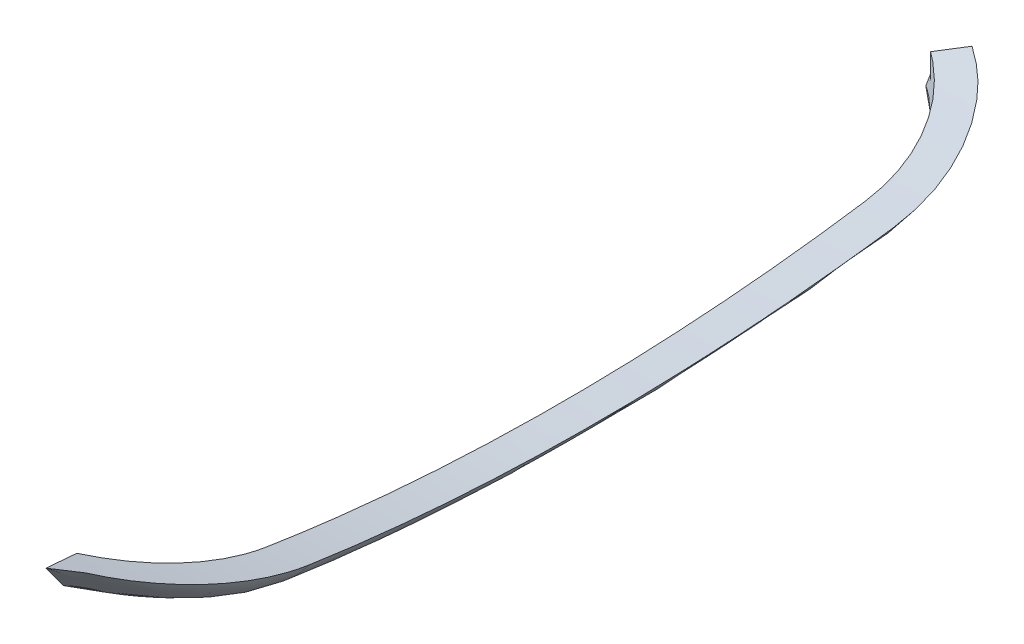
ISO-10303-21;
HEADER;
FILE_DESCRIPTION(('STEP AP214'),'2;1');
FILE_NAME('part.step','',(''),(''),'','','');
FILE_SCHEMA(('AUTOMOTIVE_DESIGN { 1 0 10303 214 1 1 1 1 }'));
ENDSEC;
DATA;
#1=APPLICATION_CONTEXT('core data for automotive mechanical design processes');
#2=APPLICATION_PROTOCOL_DEFINITION('international standard','automotive_design',2000,#1);
#3=PRODUCT_CONTEXT('',#1,'mechanical');
#4=PRODUCT('Part','Part','',(#3));
#5=PRODUCT_RELATED_PRODUCT_CATEGORY('part','',(#4));
#6=PRODUCT_DEFINITION_FORMATION('','',#4);
#7=PRODUCT_DEFINITION_CONTEXT('part definition',#1,'design');
#8=PRODUCT_DEFINITION('design','',#6,#7);
#9=PRODUCT_DEFINITION_SHAPE('','',#8);
#10=(LENGTH_UNIT() NAMED_UNIT(*) SI_UNIT(.MILLI.,.METRE.));
#11=(NAMED_UNIT(*) PLANE_ANGLE_UNIT() SI_UNIT($,.RADIAN.));
#12=(NAMED_UNIT(*) SI_UNIT($,.STERADIAN.) SOLID_ANGLE_UNIT());
#13=UNCERTAINTY_MEASURE_WITH_UNIT(LENGTH_MEASURE(1.E-05),#10,'distance_accuracy_value','');
#14=(GEOMETRIC_REPRESENTATION_CONTEXT(3) GLOBAL_UNCERTAINTY_ASSIGNED_CONTEXT((#13)) GLOBAL_UNIT_ASSIGNED_CONTEXT((#10,
#11,#12)) REPRESENTATION_CONTEXT('',''));
#15=CARTESIAN_POINT('',(0.,0.,0.));
#16=DIRECTION('',(0.,0.,1.));
#17=DIRECTION('',(1.,0.,0.));
#18=AXIS2_PLACEMENT_3D('',#15,#16,#17);
#19=CARTESIAN_POINT('',(34.5,-75.,23.));
#20=DIRECTION('',(0.,0.,-1.));
#21=DIRECTION('',(-1.,0.,0.));
#22=AXIS2_PLACEMENT_3D('',#19,#20,#21);
#23=CYLINDRICAL_SURFACE('',#22,60.);
#24=CARTESIAN_POINT('',(34.5,-75.,15.));
#25=DIRECTION('',(0.,0.,1.));
#26=DIRECTION('',(1.,0.,0.));
#27=AXIS2_PLACEMENT_3D('',#24,#25,#26);
#28=CIRCLE('',#27,60.);
#29=CARTESIAN_POINT('',(93.8708716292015,-83.6660026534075,15.));
#30=VERTEX_POINT('',#29);
#31=CARTESIAN_POINT('',(93.5858894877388,-85.4334875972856,15.));
#32=VERTEX_POINT('',#31);
#33=EDGE_CURVE('E246',#30,#32,#28,.F.);
#34=ORIENTED_EDGE('',*,*,#33,.F.);
#35=CARTESIAN_POINT('',(93.8708716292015,-83.6660026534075,-15.));
#36=CARTESIAN_POINT('',(93.8546224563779,-83.7773010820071,-14.3792062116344));
#37=CARTESIAN_POINT('',(93.8390700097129,-83.8816895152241,-13.7571771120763));
#38=CARTESIAN_POINT('',(93.8095700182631,-84.0766015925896,-12.5109109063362));
#39=CARTESIAN_POINT('',(93.7956224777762,-84.1671251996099,-11.8866737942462));
#40=CARTESIAN_POINT('',(93.7565059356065,-84.4178216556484,-10.0111173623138));
#41=CARTESIAN_POINT('',(93.7340611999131,-84.557132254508,-8.7568853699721));
#42=CARTESIAN_POINT('',(93.697851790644,-84.7788959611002,-6.25343266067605));
#43=CARTESIAN_POINT('',(93.6840191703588,-84.8617946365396,-5.00425202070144));
#44=CARTESIAN_POINT('',(93.6654922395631,-84.9723463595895,-2.50338090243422));
#45=CARTESIAN_POINT('',(93.6607978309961,-85.,-1.25169045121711));
#46=CARTESIAN_POINT('',(93.6607978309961,-85.,1.25169045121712));
#47=CARTESIAN_POINT('',(93.6654922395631,-84.9723463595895,2.50338090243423));
#48=CARTESIAN_POINT('',(93.6840191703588,-84.8617946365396,5.00425202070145));
#49=CARTESIAN_POINT('',(93.697851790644,-84.7788959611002,6.25343266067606));
#50=CARTESIAN_POINT('',(93.7340611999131,-84.557132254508,8.7568853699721));
#51=CARTESIAN_POINT('',(93.7565059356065,-84.4178216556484,10.0111173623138));
#52=CARTESIAN_POINT('',(93.7956224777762,-84.1671251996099,11.8866737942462));
#53=CARTESIAN_POINT('',(93.8095700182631,-84.0766015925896,12.5109109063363));
#54=CARTESIAN_POINT('',(93.8390700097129,-83.8816895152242,13.7571771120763));
#55=CARTESIAN_POINT('',(93.8546224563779,-83.7773010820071,14.3792062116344));
#56=CARTESIAN_POINT('',(93.8708716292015,-83.6660026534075,15.));
#57=B_SPLINE_CURVE_WITH_KNOTS('',3,(#35,#36,#37,#38,#39,#40,#41,#42,#43,#44,#45,#46,#47,#48,#49,
#50,#51,#52,#53,#54,#55,#56),.UNSPECIFIED.,.F.,.F.,(4,2,2,2,2,2,2,2,2,2,4),(0.,1.89262095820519,
3.78524698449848,7.57029319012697,11.3250851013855,15.0798367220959,18.8345883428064,
22.5893802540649,26.3744264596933,28.2670524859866,30.1596734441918),.UNSPECIFIED.);
#58=CARTESIAN_POINT('',(93.8708716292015,-83.6660026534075,-15.));
#59=VERTEX_POINT('',#58);
#60=EDGE_CURVE('E145',#59,#30,#57,.T.);
#61=ORIENTED_EDGE('',*,*,#60,.F.);
#62=CARTESIAN_POINT('',(34.5,-75.,-15.));
#63=DIRECTION('',(0.,0.,1.));
#64=DIRECTION('',(1.,0.,0.));
#65=AXIS2_PLACEMENT_3D('',#62,#63,#64);
#66=CIRCLE('',#65,60.);
#67=CARTESIAN_POINT('',(93.5858894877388,-85.4334875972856,-15.));
#68=VERTEX_POINT('',#67);
#69=EDGE_CURVE('E243',#68,#59,#66,.T.);
#70=ORIENTED_EDGE('',*,*,#69,.F.);
#71=CARTESIAN_POINT('',(93.5858894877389,-85.4334875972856,15.));
#72=CARTESIAN_POINT('',(93.5825161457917,-85.4525921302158,14.885619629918));
#73=CARTESIAN_POINT('',(93.5791384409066,-85.4716654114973,14.771233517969));
#74=CARTESIAN_POINT('',(93.5724146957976,-85.5095283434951,14.542413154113));
#75=CARTESIAN_POINT('',(93.5690686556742,-85.5283179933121,14.4279789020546));
#76=CARTESIAN_POINT('',(93.5624486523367,-85.5653924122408,14.1990263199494));
#77=CARTESIAN_POINT('',(93.5591746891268,-85.5836771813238,14.0845079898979));
#78=CARTESIAN_POINT('',(93.5526926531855,-85.6197846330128,13.855396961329));
#79=CARTESIAN_POINT('',(93.5494845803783,-85.6376073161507,13.7408042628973));
#80=CARTESIAN_POINT('',(93.5399628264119,-85.6903727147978,13.3969250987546));
#81=CARTESIAN_POINT('',(93.533751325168,-85.7246143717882,13.1675277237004));
#82=CARTESIAN_POINT('',(93.5216038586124,-85.7912660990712,12.708460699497));
#83=CARTESIAN_POINT('',(93.5156678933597,-85.8236761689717,12.4787910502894));
#84=CARTESIAN_POINT('',(93.498272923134,-85.9182374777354,11.7892779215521));
#85=CARTESIAN_POINT('',(93.487230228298,-85.9777011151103,11.3290524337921));
#86=CARTESIAN_POINT('',(93.4662857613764,-86.0896518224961,10.4077116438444));
#87=CARTESIAN_POINT('',(93.4563840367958,-86.1421386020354,9.94659630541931));
#88=CARTESIAN_POINT('',(93.4369496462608,-86.2445068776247,8.98106125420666));
#89=CARTESIAN_POINT('',(93.4275350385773,-86.2937027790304,8.47656604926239));
#90=CARTESIAN_POINT('',(93.4102558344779,-86.3834893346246,7.46678206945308));
#91=CARTESIAN_POINT('',(93.4023912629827,-86.4240798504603,6.96149328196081));
#92=CARTESIAN_POINT('',(93.3812139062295,-86.53292033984,5.4446154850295));
#93=CARTESIAN_POINT('',(93.3703178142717,-86.5882375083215,4.43203150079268));
#94=CARTESIAN_POINT('',(93.3552141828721,-86.6647002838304,2.40531617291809));
#95=CARTESIAN_POINT('',(93.3510082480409,-86.6858376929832,1.39118451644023));
#96=CARTESIAN_POINT('',(93.3493384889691,-86.6942473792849,-0.637240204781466));
#97=CARTESIAN_POINT('',(93.3518745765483,-86.6815200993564,-1.65153326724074));
#98=CARTESIAN_POINT('',(93.3607726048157,-86.636563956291,-3.18204918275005));
#99=CARTESIAN_POINT('',(93.3646496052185,-86.6169535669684,-3.69868795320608));
#100=CARTESIAN_POINT('',(93.3741262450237,-86.5688321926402,-4.73154023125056));
#101=CARTESIAN_POINT('',(93.3797258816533,-86.5403212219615,-5.2477537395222));
#102=CARTESIAN_POINT('',(93.3926185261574,-86.4743456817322,-6.27958968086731));
#103=CARTESIAN_POINT('',(93.3999115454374,-86.4368810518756,-6.79521210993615));
#104=CARTESIAN_POINT('',(93.4161458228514,-86.3529549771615,-7.8256991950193));
#105=CARTESIAN_POINT('',(93.4250870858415,-86.3064935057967,-8.34056384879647));
#106=CARTESIAN_POINT('',(93.4445247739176,-86.204717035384,-9.36928237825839));
#107=CARTESIAN_POINT('',(93.4550208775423,-86.1494038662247,-9.88313644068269));
#108=CARTESIAN_POINT('',(93.4718516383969,-86.0599110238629,-10.6531284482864));
#109=CARTESIAN_POINT('',(93.4776430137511,-86.028992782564,-10.90966177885));
#110=CARTESIAN_POINT('',(93.4895725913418,-85.9650073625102,-11.4224528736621));
#111=CARTESIAN_POINT('',(93.495710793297,-85.931940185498,-11.678710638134));
#112=CARTESIAN_POINT('',(93.5083349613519,-85.8635911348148,-12.1909221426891));
#113=CARTESIAN_POINT('',(93.5148209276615,-85.8283092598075,-12.4468758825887));
#114=CARTESIAN_POINT('',(93.528141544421,-85.7554580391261,-12.9584493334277));
#115=CARTESIAN_POINT('',(93.5349761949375,-85.7178886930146,-13.2140690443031));
#116=CARTESIAN_POINT('',(93.5454887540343,-85.6597675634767,-13.597222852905));
#117=CARTESIAN_POINT('',(93.5490363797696,-85.6400992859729,-13.7248951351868));
#118=CARTESIAN_POINT('',(93.5562178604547,-85.6001672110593,-13.980144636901));
#119=CARTESIAN_POINT('',(93.5598517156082,-85.5799034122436,-14.1077218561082));
#120=CARTESIAN_POINT('',(93.5672063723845,-85.5387648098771,-14.3627749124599));
#121=CARTESIAN_POINT('',(93.570927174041,-85.5178900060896,-14.4902507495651));
#122=CARTESIAN_POINT('',(93.5783994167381,-85.4758382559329,-14.7451510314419));
#123=CARTESIAN_POINT('',(93.5821508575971,-85.4546613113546,-14.8725754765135));
#124=CARTESIAN_POINT('',(93.5858894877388,-85.4334875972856,-15.));
#125=B_SPLINE_CURVE_WITH_KNOTS('',3,(#71,#72,#73,#74,#75,#76,#77,#78,#79,#80,#81,#82,#83,#84,
#85,#86,#87,#88,#89,#90,#91,#92,#93,#94,#95,#96,#97,#98,#99,#100,#101,#102,#103,#104,#105,#106,
#107,#108,#109,#110,#111,#112,#113,#114,#115,#116,#117,#118,#119,#120,#121,#122,#123,#124),
.UNSPECIFIED.,.F.,.F.,(4,2,2,2,2,2,2,2,2,2,2,2,2,2,2,2,2,2,2,2,2,2,2,2,2,2,4),(0.,
0.348042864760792,0.696086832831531,1.04413082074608,1.39217440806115,2.08823166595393,
2.7842890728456,4.17677477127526,5.56931842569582,7.09016454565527,8.61103511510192,
11.6528258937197,14.6953461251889,17.7378265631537,19.2888371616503,20.8398452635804,
22.3908638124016,23.9418869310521,25.4925898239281,26.2679463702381,27.0433022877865,
27.8186586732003,28.5940152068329,28.9816953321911,29.3693763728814,29.7570575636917,
30.1447364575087),.UNSPECIFIED.);
#126=EDGE_CURVE('E222',#32,#68,#125,.T.);
#127=ORIENTED_EDGE('',*,*,#126,.F.);
#128=EDGE_LOOP('',(#34,#61,#70,#127));
#129=FACE_BOUND('',#128,.T.);
#130=ADVANCED_FACE('F86',(#129),#23,.F.);
#131=CARTESIAN_POINT('',(34.5,-75.,15.));
#132=DIRECTION('',(0.,0.,1.));
#133=DIRECTION('',(1.,0.,0.));
#134=AXIS2_PLACEMENT_3D('',#131,#132,#133);
#135=TOROIDAL_SURFACE('',#134,52.,8.);
#136=CARTESIAN_POINT('',(77.6381475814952,-83.6660385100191,14.9998));
#137=CARTESIAN_POINT('',(77.6464624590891,-83.6244949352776,15.2315785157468));
#138=CARTESIAN_POINT('',(77.6652199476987,-83.5820410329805,15.4627791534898));
#139=CARTESIAN_POINT('',(77.7230004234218,-83.4957200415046,15.922277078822));
#140=CARTESIAN_POINT('',(77.762015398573,-83.4518535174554,16.15057547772));
#141=CARTESIAN_POINT('',(77.8595745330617,-83.3631941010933,16.6021326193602));
#142=CARTESIAN_POINT('',(77.9180688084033,-83.3184038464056,16.8254026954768));
#143=CARTESIAN_POINT('',(78.0538698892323,-83.2282085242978,17.2660318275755));
#144=CARTESIAN_POINT('',(78.1311782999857,-83.1828034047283,17.483390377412));
#145=CARTESIAN_POINT('',(78.303669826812,-83.0918897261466,17.91048514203));
#146=CARTESIAN_POINT('',(78.3988270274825,-83.04638141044,18.1202318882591));
#147=CARTESIAN_POINT('',(78.6062669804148,-82.9556371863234,18.5312322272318));
#148=CARTESIAN_POINT('',(78.7185559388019,-82.9104013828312,18.7324827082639));
#149=CARTESIAN_POINT('',(78.9593731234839,-82.8206781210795,19.1252679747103));
#150=CARTESIAN_POINT('',(79.0879056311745,-82.7761908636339,19.3168001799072));
#151=CARTESIAN_POINT('',(79.3603119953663,-82.6884444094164,19.6890259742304));
#152=CARTESIAN_POINT('',(79.5041912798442,-82.645185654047,19.8697156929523));
#153=CARTESIAN_POINT('',(79.812620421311,-82.5586318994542,20.22640285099));
#154=CARTESIAN_POINT('',(79.9777825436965,-82.5154108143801,20.4018892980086));
#155=CARTESIAN_POINT('',(80.3225746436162,-82.4314143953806,20.7386606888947));
#156=CARTESIAN_POINT('',(80.5022046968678,-82.390639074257,20.8999455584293));
#157=CARTESIAN_POINT('',(80.8748139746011,-82.3120871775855,21.2072030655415));
#158=CARTESIAN_POINT('',(81.0677966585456,-82.2743113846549,21.353171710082));
#159=CARTESIAN_POINT('',(81.4657475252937,-82.2023430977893,21.6285701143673));
#160=CARTESIAN_POINT('',(81.6707110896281,-82.1681492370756,21.7580061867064));
#161=CARTESIAN_POINT('',(82.0923914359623,-82.1037125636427,21.9999121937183));
#162=CARTESIAN_POINT('',(82.3091612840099,-82.0734901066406,22.1122951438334));
#163=CARTESIAN_POINT('',(82.7519527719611,-82.0177307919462,22.3182261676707));
#164=CARTESIAN_POINT('',(82.9779706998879,-81.9921920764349,22.4117817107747));
#165=CARTESIAN_POINT('',(83.4377167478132,-81.9462658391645,22.5791286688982));
#166=CARTESIAN_POINT('',(83.6714446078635,-81.9258781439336,22.6529207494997));
#167=CARTESIAN_POINT('',(84.144851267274,-81.890672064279,22.7798634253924));
#168=CARTESIAN_POINT('',(84.3845297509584,-81.8758533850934,22.8330151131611));
#169=CARTESIAN_POINT('',(84.856343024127,-81.8526903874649,22.9159079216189));
#170=CARTESIAN_POINT('',(85.0882887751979,-81.8440697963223,22.9466490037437));
#171=CARTESIAN_POINT('',(85.5540924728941,-81.8323886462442,22.988271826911));
#172=CARTESIAN_POINT('',(85.7879503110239,-81.8293277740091,22.9991546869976));
#173=CARTESIAN_POINT('',(86.2556831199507,-81.8288792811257,23.0007503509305));
#174=CARTESIAN_POINT('',(86.4895580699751,-81.8314901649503,22.9914684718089));
#175=CARTESIAN_POINT('',(86.9554845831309,-81.8423927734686,22.9526284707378));
#176=CARTESIAN_POINT('',(87.187536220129,-81.8506842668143,22.9230711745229));
#177=CARTESIAN_POINT('',(87.6352660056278,-81.8722412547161,22.8459539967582));
#178=CARTESIAN_POINT('',(87.8511444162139,-81.8852091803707,22.7994697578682));
#179=CARTESIAN_POINT('',(88.2779415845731,-81.9159605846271,22.6887351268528));
#180=CARTESIAN_POINT('',(88.4888605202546,-81.9337438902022,22.6244853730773));
#181=CARTESIAN_POINT('',(88.9041438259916,-81.9738726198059,22.4786547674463));
#182=CARTESIAN_POINT('',(89.1085089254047,-81.9962175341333,22.3970758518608));
#183=CARTESIAN_POINT('',(89.5092012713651,-82.0451464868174,22.2171695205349));
#184=CARTESIAN_POINT('',(89.7055285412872,-82.0717305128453,22.1188421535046));
#185=CARTESIAN_POINT('',(90.0846214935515,-82.1281404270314,21.9084492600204));
#186=CARTESIAN_POINT('',(90.2675873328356,-82.1578848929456,21.7967222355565));
#187=CARTESIAN_POINT('',(90.6232772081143,-82.2206637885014,21.5587011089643));
#188=CARTESIAN_POINT('',(90.7959977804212,-82.2536993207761,21.4324021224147));
#189=CARTESIAN_POINT('',(91.1299517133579,-82.322599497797,21.1662113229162));
#190=CARTESIAN_POINT('',(91.2911877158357,-82.3584634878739,21.0263226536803));
#191=CARTESIAN_POINT('',(91.6011936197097,-82.432561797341,20.7339214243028));
#192=CARTESIAN_POINT('',(91.7499629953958,-82.4707962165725,20.5814083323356));
#193=CARTESIAN_POINT('',(92.0359009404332,-82.5496496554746,20.2628378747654));
#194=CARTESIAN_POINT('',(92.1728997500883,-82.590292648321,20.0966340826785));
#195=CARTESIAN_POINT('',(92.4323261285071,-82.6730187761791,19.753559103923));
#196=CARTESIAN_POINT('',(92.5547536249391,-82.7151019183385,19.5766878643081));
#197=CARTESIAN_POINT('',(92.784363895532,-82.800237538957,19.2134191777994));
#198=CARTESIAN_POINT('',(92.8915396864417,-82.8432904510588,19.0270174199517));
#199=CARTESIAN_POINT('',(93.0899629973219,-82.9298722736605,18.6460302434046));
#200=CARTESIAN_POINT('',(93.1812104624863,-82.9734011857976,18.4514447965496));
#201=CARTESIAN_POINT('',(93.3494265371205,-83.0616164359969,18.0502394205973));
#202=CARTESIAN_POINT('',(93.425962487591,-83.1063034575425,17.8434381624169));
#203=CARTESIAN_POINT('',(93.5612695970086,-83.1952334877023,17.4240937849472));
#204=CARTESIAN_POINT('',(93.6200468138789,-83.2394766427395,17.2115526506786));
#205=CARTESIAN_POINT('',(93.7194915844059,-83.3270657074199,16.7823728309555));
#206=CARTESIAN_POINT('',(93.7601800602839,-83.3704125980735,16.5657391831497));
#207=CARTESIAN_POINT('',(93.8233202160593,-83.4558727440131,16.1296812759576));
#208=CARTESIAN_POINT('',(93.8457811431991,-83.4979866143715,15.9102584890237));
#209=CARTESIAN_POINT('',(93.8660395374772,-83.5609046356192,15.5752660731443));
#210=CARTESIAN_POINT('',(93.8704935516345,-83.5822761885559,15.4601685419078));
#211=CARTESIAN_POINT('',(93.8744104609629,-83.6245266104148,15.2299780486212));
#212=CARTESIAN_POINT('',(93.8738808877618,-83.6454061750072,15.1148853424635));
#213=CARTESIAN_POINT('',(93.8708663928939,-83.6660385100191,14.9998));
#214=B_SPLINE_CURVE_WITH_KNOTS('',3,(#136,#137,#138,#139,#140,#141,#142,#143,#144,#145,#146,
#147,#148,#149,#150,#151,#152,#153,#154,#155,#156,#157,#158,#159,#160,#161,#162,#163,#164,#165,
#166,#167,#168,#169,#170,#171,#172,#173,#174,#175,#176,#177,#178,#179,#180,#181,#182,#183,#184,
#185,#186,#187,#188,#189,#190,#191,#192,#193,#194,#195,#196,#197,#198,#199,#200,#201,#202,#203,
#204,#205,#206,#207,#208,#209,#210,#211,#212,#213),.UNSPECIFIED.,.F.,.F.,(4,2,2,2,2,2,2,2,2,2,2,
2,2,2,2,2,2,2,2,2,2,2,2,2,2,2,2,2,2,2,2,2,2,2,2,2,2,2,4),(0.,0.706568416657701,1.41285759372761,
2.11735178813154,2.8219061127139,3.52544527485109,4.22923990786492,4.93322043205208,
5.63745077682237,6.37108758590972,7.10472823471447,7.83855967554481,8.57211007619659,
9.30928474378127,10.0461663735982,10.7830231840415,11.5198409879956,12.2213432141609,
12.9228059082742,13.6240836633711,14.3253328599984,14.9881424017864,15.6509281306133,
16.3136398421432,16.9763496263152,17.6248967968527,18.2736619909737,18.9222774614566,
19.5709202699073,20.2277347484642,20.8845524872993,21.5416700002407,22.1987897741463,
22.8729851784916,23.5469503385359,24.220133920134,24.8929757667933,25.2443306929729,
25.5951547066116),.UNSPECIFIED.);
#215=CARTESIAN_POINT('',(90.2101202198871,-82.7262597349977,22.3660429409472));
#216=VERTEX_POINT('',#215);
#217=EDGE_CURVE('E142',#216,#30,#214,.T.);
#218=ORIENTED_EDGE('',*,*,#217,.T.);
#219=ORIENTED_EDGE('',*,*,#33,.T.);
#220=CARTESIAN_POINT('',(90.057001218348,-83.8303210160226,21.7749741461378));
#221=CARTESIAN_POINT('',(90.3067721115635,-83.792249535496,21.6241791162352));
#222=CARTESIAN_POINT('',(90.5442368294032,-83.8034881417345,21.4573528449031));
#223=CARTESIAN_POINT('',(90.8447303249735,-83.8502757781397,21.2171201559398));
#224=CARTESIAN_POINT('',(90.9194239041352,-83.8648778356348,21.1547473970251));
#225=CARTESIAN_POINT('',(91.0659133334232,-83.8975887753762,21.0272105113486));
#226=CARTESIAN_POINT('',(91.1376999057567,-83.9157079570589,20.9620386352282));
#227=CARTESIAN_POINT('',(91.2785250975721,-83.9538129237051,20.8290024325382));
#228=CARTESIAN_POINT('',(91.3475573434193,-83.9738027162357,20.7611325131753));
#229=CARTESIAN_POINT('',(91.4828669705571,-84.014506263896,20.6228636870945));
#230=CARTESIAN_POINT('',(91.5491432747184,-84.0352202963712,20.5524638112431));
#231=CARTESIAN_POINT('',(91.6795056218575,-84.0767486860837,20.4086491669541));
#232=CARTESIAN_POINT('',(91.7435707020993,-84.0975625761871,20.3352152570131));
#233=CARTESIAN_POINT('',(91.8687312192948,-84.1393499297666,20.1860761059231));
#234=CARTESIAN_POINT('',(91.9298304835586,-84.1603231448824,20.1103740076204));
#235=CARTESIAN_POINT('',(92.0489746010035,-84.2026338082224,19.9567932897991));
#236=CARTESIAN_POINT('',(92.1070216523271,-84.2239709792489,19.8789163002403));
#237=CARTESIAN_POINT('',(92.2199814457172,-84.2671830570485,19.7210812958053));
#238=CARTESIAN_POINT('',(92.2748945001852,-84.2890579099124,19.6411234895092));
#239=CARTESIAN_POINT('',(92.4006986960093,-84.3411396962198,19.4501609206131));
#240=CARTESIAN_POINT('',(92.4702482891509,-84.3715184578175,19.3383158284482));
#241=CARTESIAN_POINT('',(92.6034160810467,-84.4327291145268,19.1111973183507));
#242=CARTESIAN_POINT('',(92.6670313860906,-84.4635612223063,18.9959222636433));
#243=CARTESIAN_POINT('',(92.7881607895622,-84.5255948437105,18.7622869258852));
#244=CARTESIAN_POINT('',(92.845674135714,-84.5567964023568,18.6439262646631));
#245=CARTESIAN_POINT('',(92.9542594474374,-84.6193609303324,18.4049078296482));
#246=CARTESIAN_POINT('',(93.0053552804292,-84.6507228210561,18.2842606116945));
#247=CARTESIAN_POINT('',(93.1012676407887,-84.7135745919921,18.0405497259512));
#248=CARTESIAN_POINT('',(93.1460850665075,-84.7450644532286,17.9174864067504));
#249=CARTESIAN_POINT('',(93.2293701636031,-84.8080516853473,17.6692379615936));
#250=CARTESIAN_POINT('',(93.267838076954,-84.8395490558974,17.5440529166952));
#251=CARTESIAN_POINT('',(93.3395127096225,-84.9034452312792,17.2877606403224));
#252=CARTESIAN_POINT('',(93.3725077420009,-84.9358400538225,17.1565931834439));
#253=CARTESIAN_POINT('',(93.4316179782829,-85.0003635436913,16.8926423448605));
#254=CARTESIAN_POINT('',(93.4577326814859,-85.0324921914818,16.759858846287));
#255=CARTESIAN_POINT('',(93.5030494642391,-85.0963283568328,16.4930104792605));
#256=CARTESIAN_POINT('',(93.5222511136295,-85.1280358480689,16.358945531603));
#257=CARTESIAN_POINT('',(93.5537920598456,-85.1910118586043,16.0892804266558));
#258=CARTESIAN_POINT('',(93.5661012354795,-85.2222778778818,15.9536761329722));
#259=CARTESIAN_POINT('',(93.5793219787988,-85.2686076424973,15.7498177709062));
#260=CARTESIAN_POINT('',(93.5828550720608,-85.2839562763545,15.6817885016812));
#261=CARTESIAN_POINT('',(93.5881663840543,-85.3144944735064,15.5456242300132));
#262=CARTESIAN_POINT('',(93.5899446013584,-85.3296840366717,15.4774892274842));
#263=CARTESIAN_POINT('',(93.5917606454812,-85.3598154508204,15.3411520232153));
#264=CARTESIAN_POINT('',(93.5917987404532,-85.3747573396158,15.2729498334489));
#265=CARTESIAN_POINT('',(93.5905661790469,-85.3968971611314,15.170601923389));
#266=CARTESIAN_POINT('',(93.5899403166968,-85.4042319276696,15.1364769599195));
#267=CARTESIAN_POINT('',(93.5886755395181,-85.4151843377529,15.0852869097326));
#268=CARTESIAN_POINT('',(93.5881996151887,-85.4188268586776,15.0682230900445));
#269=CARTESIAN_POINT('',(93.5871325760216,-85.426132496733,15.0341033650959));
#270=CARTESIAN_POINT('',(93.5865414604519,-85.4297956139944,15.0170474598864));
#271=CARTESIAN_POINT('',(93.5858894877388,-85.4334875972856,15.));
#272=B_SPLINE_CURVE_WITH_KNOTS('',3,(#220,#221,#222,#223,#224,#225,#226,#227,#228,#229,#230,
#231,#232,#233,#234,#235,#236,#237,#238,#239,#240,#241,#242,#243,#244,#245,#246,#247,#248,#249,
#250,#251,#252,#253,#254,#255,#256,#257,#258,#259,#260,#261,#262,#263,#264,#265,#266,#267,#268,
#269,#270,#271),.UNSPECIFIED.,.F.,.F.,(4,2,2,2,2,2,2,2,2,2,2,2,2,2,2,2,2,2,2,2,2,2,2,2,2,4),(0.,
0.86789791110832,1.16283785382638,1.45865488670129,1.75512085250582,2.05170162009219,
2.3505815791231,2.64906498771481,2.94733040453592,3.24556603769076,3.65087375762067,
4.05637809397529,4.4619323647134,4.86593061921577,5.26987100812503,5.67379599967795,
6.09085200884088,6.50793835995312,6.92505065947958,7.34397185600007,7.55343958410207,
7.76290748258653,7.97234310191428,8.07707045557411,8.1294343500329,8.18179857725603),.UNSPECIFIED.);
#273=EDGE_CURVE('E125',#216,#32,#272,.T.);
#274=ORIENTED_EDGE('',*,*,#273,.F.);
#275=EDGE_LOOP('',(#218,#219,#274));
#276=FACE_BOUND('',#275,.T.);
#277=ADVANCED_FACE('F227',(#276),#135,.F.);
#278=CARTESIAN_POINT('',(34.5,-75.,-15.));
#279=DIRECTION('',(0.,0.,1.));
#280=DIRECTION('',(1.,0.,0.));
#281=AXIS2_PLACEMENT_3D('',#278,#279,#280);
#282=TOROIDAL_SURFACE('',#281,52.,8.);
#283=CARTESIAN_POINT('',(93.5858894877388,-85.4334875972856,-15.));
#284=CARTESIAN_POINT('',(93.5866120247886,-85.4293960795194,-15.0189105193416));
#285=CARTESIAN_POINT('',(93.5872599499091,-85.4253384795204,-15.037831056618));
#286=CARTESIAN_POINT('',(93.5884144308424,-85.4172464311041,-15.0756812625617));
#287=CARTESIAN_POINT('',(93.5889209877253,-85.4132119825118,-15.0946109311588));
#288=CARTESIAN_POINT('',(93.5902403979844,-85.4010762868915,-15.151397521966));
#289=CARTESIAN_POINT('',(93.5908529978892,-85.3929426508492,-15.1892522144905));
#290=CARTESIAN_POINT('',(93.591891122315,-85.3684065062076,-15.3027942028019));
#291=CARTESIAN_POINT('',(93.5915170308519,-85.3518684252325,-15.3784609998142));
#292=CARTESIAN_POINT('',(93.5886128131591,-85.3185642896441,-15.5297090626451));
#293=CARTESIAN_POINT('',(93.5860825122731,-85.3017982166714,-15.6052903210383));
#294=CARTESIAN_POINT('',(93.5788556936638,-85.2681023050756,-15.7563104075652));
#295=CARTESIAN_POINT('',(93.5741591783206,-85.2511724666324,-15.8317492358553));
#296=CARTESIAN_POINT('',(93.5568349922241,-85.200080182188,-16.0577515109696));
#297=CARTESIAN_POINT('',(93.5409724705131,-85.1656125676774,-16.2080116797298));
#298=CARTESIAN_POINT('',(93.5006689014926,-85.0961470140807,-16.5069363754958));
#299=CARTESIAN_POINT('',(93.4762443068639,-85.0611502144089,-16.6556034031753));
#300=CARTESIAN_POINT('',(93.4188613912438,-84.9906822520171,-16.9511620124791));
#301=CARTESIAN_POINT('',(93.3859035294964,-84.9552111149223,-17.0980536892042));
#302=CARTESIAN_POINT('',(93.3115255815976,-84.8839426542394,-17.389590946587));
#303=CARTESIAN_POINT('',(93.2701058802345,-84.848145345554,-17.5342366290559));
#304=CARTESIAN_POINT('',(93.178961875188,-84.7764166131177,-17.8206277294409));
#305=CARTESIAN_POINT('',(93.1292488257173,-84.7404854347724,-17.9623767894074));
#306=CARTESIAN_POINT('',(93.0216046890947,-84.6685655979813,-18.2427157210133));
#307=CARTESIAN_POINT('',(92.9636730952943,-84.6325769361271,-18.3813053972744));
#308=CARTESIAN_POINT('',(92.8397214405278,-84.5607436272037,-18.6548868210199));
#309=CARTESIAN_POINT('',(92.7737001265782,-84.5248990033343,-18.7898780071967));
#310=CARTESIAN_POINT('',(92.6336544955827,-84.453491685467,-19.0559649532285));
#311=CARTESIAN_POINT('',(92.5596194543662,-84.4179294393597,-19.1870551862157));
#312=CARTESIAN_POINT('',(92.4038016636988,-84.3474182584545,-19.444701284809));
#313=CARTESIAN_POINT('',(92.3220202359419,-84.3124692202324,-19.5712579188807));
#314=CARTESIAN_POINT('',(92.1936802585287,-84.2609095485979,-19.7573449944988));
#315=CARTESIAN_POINT('',(92.1499663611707,-84.243870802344,-19.8187356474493));
#316=CARTESIAN_POINT('',(92.0606718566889,-84.2101003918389,-19.9402293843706));
#317=CARTESIAN_POINT('',(92.0150913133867,-84.193368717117,-20.0003325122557));
#318=CARTESIAN_POINT('',(91.912902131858,-84.1568314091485,-20.1309737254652));
#319=CARTESIAN_POINT('',(91.8558991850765,-84.1370742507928,-20.2012172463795));
#320=CARTESIAN_POINT('',(91.7393909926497,-84.0977615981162,-20.3396638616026));
#321=CARTESIAN_POINT('',(91.6798855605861,-84.0782061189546,-20.407866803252));
#322=CARTESIAN_POINT('',(91.5584525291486,-84.0390928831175,-20.5421719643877));
#323=CARTESIAN_POINT('',(91.4965232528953,-84.0195351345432,-20.608272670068));
#324=CARTESIAN_POINT('',(91.3705616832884,-83.9811323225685,-20.7379288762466));
#325=CARTESIAN_POINT('',(91.3065426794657,-83.9622839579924,-20.801496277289));
#326=CARTESIAN_POINT('',(91.1760363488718,-83.9260243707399,-20.9263728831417));
#327=CARTESIAN_POINT('',(91.109550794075,-83.9086121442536,-20.9876836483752));
#328=CARTESIAN_POINT('',(90.9740108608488,-83.8765155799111,-21.1079322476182));
#329=CARTESIAN_POINT('',(90.9049616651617,-83.8618260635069,-21.1668744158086));
#330=CARTESIAN_POINT('',(90.5907470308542,-83.8057894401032,-21.4245359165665));
#331=CARTESIAN_POINT('',(90.3308660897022,-83.7879471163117,-21.6097953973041));
#332=CARTESIAN_POINT('',(90.0552080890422,-83.8287302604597,-21.7762425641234));
#333=B_SPLINE_CURVE_WITH_KNOTS('',3,(#283,#284,#285,#286,#287,#288,#289,#290,#291,#292,#293,
#294,#295,#296,#297,#298,#299,#300,#301,#302,#303,#304,#305,#306,#307,#308,#309,#310,#311,#312,
#313,#314,#315,#316,#317,#318,#319,#320,#321,#322,#323,#324,#325,#326,#327,#328,#329,#330,#331,
#332),.UNSPECIFIED.,.F.,.F.,(4,2,2,2,2,2,2,2,2,2,2,2,2,2,2,2,2,2,2,2,2,2,2,2,4),(0.,
0.0580842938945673,0.116168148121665,0.232335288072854,0.464664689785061,0.697012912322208,
0.929360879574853,1.39402327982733,1.85779764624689,2.32154705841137,2.78527538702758,
3.24837947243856,3.71151211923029,4.17471658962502,4.63854878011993,5.10230197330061,
5.33407169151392,5.56583349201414,5.84356036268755,6.12130795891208,6.39925122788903,
6.67568084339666,6.95191557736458,7.22761940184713,8.18268568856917),.UNSPECIFIED.);
#334=CARTESIAN_POINT('',(90.210120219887,-82.7262597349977,-22.3660429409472));
#335=VERTEX_POINT('',#334);
#336=EDGE_CURVE('E106',#68,#335,#333,.T.);
#337=ORIENTED_EDGE('',*,*,#336,.F.);
#338=ORIENTED_EDGE('',*,*,#69,.T.);
#339=CARTESIAN_POINT('',(93.8708663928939,-83.6660385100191,-14.9998));
#340=CARTESIAN_POINT('',(93.8767887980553,-83.6256595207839,-15.2250785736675));
#341=CARTESIAN_POINT('',(93.8731495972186,-83.5843092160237,-15.4504341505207));
#342=CARTESIAN_POINT('',(93.8468277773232,-83.5000021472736,-15.8997316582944));
#343=CARTESIAN_POINT('',(93.8241448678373,-83.4570453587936,-16.1236735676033));
#344=CARTESIAN_POINT('',(93.7598127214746,-83.3698593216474,-16.5685865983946));
#345=CARTESIAN_POINT('',(93.7181619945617,-83.3256299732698,-16.7895574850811));
#346=CARTESIAN_POINT('',(93.6161267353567,-83.2363027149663,-17.2269470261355));
#347=CARTESIAN_POINT('',(93.5557426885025,-83.1912048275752,-17.4433657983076));
#348=CARTESIAN_POINT('',(93.4165281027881,-83.1005443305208,-17.8702882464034));
#349=CARTESIAN_POINT('',(93.3376828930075,-83.0549813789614,-18.080787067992));
#350=CARTESIAN_POINT('',(93.1620399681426,-82.9639098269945,-18.4941738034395));
#351=CARTESIAN_POINT('',(93.0652421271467,-82.9184012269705,-18.6970616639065));
#352=CARTESIAN_POINT('',(92.854328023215,-82.8279746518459,-19.0936631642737));
#353=CARTESIAN_POINT('',(92.7402184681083,-82.7830564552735,-19.2873803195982));
#354=CARTESIAN_POINT('',(92.4953753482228,-82.6943384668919,-19.6642790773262));
#355=CARTESIAN_POINT('',(92.3646420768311,-82.6505386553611,-19.8474608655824));
#356=CARTESIAN_POINT('',(92.0891707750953,-82.5651678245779,-20.1996406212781));
#357=CARTESIAN_POINT('',(91.9446323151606,-82.5235755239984,-20.3687895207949));
#358=CARTESIAN_POINT('',(91.6411366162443,-82.4425796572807,-20.6941821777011));
#359=CARTESIAN_POINT('',(91.4821797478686,-82.4031760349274,-20.8504262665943));
#360=CARTESIAN_POINT('',(91.1509169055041,-82.3270991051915,-21.148817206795));
#361=CARTESIAN_POINT('',(90.9786100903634,-82.2904259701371,-21.2909631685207));
#362=CARTESIAN_POINT('',(90.6218721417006,-82.2203407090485,-21.5600303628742));
#363=CARTESIAN_POINT('',(90.4374412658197,-82.1869285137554,-21.6869519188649));
#364=CARTESIAN_POINT('',(90.062613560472,-82.1246603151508,-21.9215539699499));
#365=CARTESIAN_POINT('',(89.8724864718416,-82.0957102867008,-22.0296406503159));
#366=CARTESIAN_POINT('',(89.4833456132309,-82.0417951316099,-22.2295879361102));
#367=CARTESIAN_POINT('',(89.2843320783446,-82.0168298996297,-22.3214489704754));
#368=CARTESIAN_POINT('',(88.878903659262,-81.9712503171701,-22.4882547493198));
#369=CARTESIAN_POINT('',(88.6724902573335,-81.9506351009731,-22.5632028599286));
#370=CARTESIAN_POINT('',(88.2537486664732,-81.9140450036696,-22.6956815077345));
#371=CARTESIAN_POINT('',(88.0414205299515,-81.8980700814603,-22.7532121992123));
#372=CARTESIAN_POINT('',(87.616338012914,-81.8712271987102,-22.849608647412));
#373=CARTESIAN_POINT('',(87.4036618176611,-81.8602715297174,-22.888795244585));
#374=CARTESIAN_POINT('',(86.9755760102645,-81.8431728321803,-22.949859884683));
#375=CARTESIAN_POINT('',(86.7601654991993,-81.8370314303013,-22.9717320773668));
#376=CARTESIAN_POINT('',(86.3282428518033,-81.829620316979,-22.9981178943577));
#377=CARTESIAN_POINT('',(86.1117309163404,-81.8283497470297,-23.0026345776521));
#378=CARTESIAN_POINT('',(85.6790544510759,-81.830651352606,-22.9944453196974));
#379=CARTESIAN_POINT('',(85.4628899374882,-81.8342237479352,-22.9817385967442));
#380=CARTESIAN_POINT('',(85.0299475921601,-81.8461773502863,-22.9391313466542));
#381=CARTESIAN_POINT('',(84.8131901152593,-81.8546120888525,-22.9090394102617));
#382=CARTESIAN_POINT('',(84.382945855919,-81.8761555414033,-22.8319239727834));
#383=CARTESIAN_POINT('',(84.1694591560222,-81.8892643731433,-22.7849000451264));
#384=CARTESIAN_POINT('',(83.7471137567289,-81.9199180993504,-22.6744415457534));
#385=CARTESIAN_POINT('',(83.5382548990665,-81.9374628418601,-22.6110075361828));
#386=CARTESIAN_POINT('',(83.1263424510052,-81.976706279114,-22.4683132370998));
#387=CARTESIAN_POINT('',(82.9232909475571,-81.9984064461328,-22.3890473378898));
#388=CARTESIAN_POINT('',(82.5151329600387,-82.0467040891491,-22.2114204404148));
#389=CARTESIAN_POINT('',(82.310354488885,-82.0734796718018,-22.1123538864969));
#390=CARTESIAN_POINT('',(81.9096616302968,-82.130804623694,-21.8984745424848));
#391=CARTESIAN_POINT('',(81.7137503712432,-82.1613553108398,-21.783656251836));
#392=CARTESIAN_POINT('',(81.3319963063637,-82.2257859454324,-21.5391759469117));
#393=CARTESIAN_POINT('',(81.1461536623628,-82.2596659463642,-21.4095136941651));
#394=CARTESIAN_POINT('',(80.7855899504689,-82.3303023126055,-21.1362539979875));
#395=CARTESIAN_POINT('',(80.6108693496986,-82.3670587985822,-20.9926559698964));
#396=CARTESIAN_POINT('',(80.2641246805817,-82.4451072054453,-20.6840762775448));
#397=CARTESIAN_POINT('',(80.0927951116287,-82.4865377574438,-20.5183485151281));
#398=CARTESIAN_POINT('',(79.7647968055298,-82.5715339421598,-20.1735790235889));
#399=CARTESIAN_POINT('',(79.6081237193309,-82.6150989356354,-19.9945412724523));
#400=CARTESIAN_POINT('',(79.3102871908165,-82.7038796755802,-19.6240820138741));
#401=CARTESIAN_POINT('',(79.1691389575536,-82.7490969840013,-19.4326486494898));
#402=CARTESIAN_POINT('',(78.9036025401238,-82.8405911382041,-19.0388367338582));
#403=CARTESIAN_POINT('',(78.7792080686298,-82.8868675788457,-18.83646232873));
#404=CARTESIAN_POINT('',(78.5454496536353,-82.981046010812,-18.4171987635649));
#405=CARTESIAN_POINT('',(78.4364970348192,-83.028960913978,-18.2000828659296));
#406=CARTESIAN_POINT('',(78.2381737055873,-83.1248069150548,-17.7571895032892));
#407=CARTESIAN_POINT('',(78.1487949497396,-83.1727379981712,-17.5314156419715));
#408=CARTESIAN_POINT('',(77.9906658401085,-83.2680325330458,-17.0730624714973));
#409=CARTESIAN_POINT('',(77.9218822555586,-83.3153967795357,-16.8404947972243));
#410=CARTESIAN_POINT('',(77.8056729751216,-83.4091164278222,-16.3699959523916));
#411=CARTESIAN_POINT('',(77.7582345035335,-83.4554724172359,-16.1320680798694));
#412=CARTESIAN_POINT('',(77.6993985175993,-83.5292225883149,-15.7445747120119));
#413=CARTESIAN_POINT('',(77.6811561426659,-83.5570727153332,-15.5961047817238));
#414=CARTESIAN_POINT('',(77.6532242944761,-83.6120847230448,-15.2984384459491));
#415=CARTESIAN_POINT('',(77.6435237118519,-83.6392474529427,-15.1492432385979));
#416=CARTESIAN_POINT('',(77.6381475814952,-83.6660385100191,-14.9998));
#417=B_SPLINE_CURVE_WITH_KNOTS('',3,(#339,#340,#341,#342,#343,#344,#345,#346,#347,#348,#349,
#350,#351,#352,#353,#354,#355,#356,#357,#358,#359,#360,#361,#362,#363,#364,#365,#366,#367,#368,
#369,#370,#371,#372,#373,#374,#375,#376,#377,#378,#379,#380,#381,#382,#383,#384,#385,#386,#387,
#388,#389,#390,#391,#392,#393,#394,#395,#396,#397,#398,#399,#400,#401,#402,#403,#404,#405,#406,
#407,#408,#409,#410,#411,#412,#413,#414,#415,#416),.UNSPECIFIED.,.F.,.F.,(4,2,2,2,2,2,2,2,2,2,2,
2,2,2,2,2,2,2,2,2,2,2,2,2,2,2,2,2,2,2,2,2,2,2,2,2,2,2,4),(0.,0.686636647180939,1.37328376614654,
2.05998483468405,2.74666811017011,3.43389894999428,4.12113460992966,4.80810466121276,
5.49506259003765,6.17327141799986,6.8514628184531,7.52969698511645,8.2079167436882,
8.86894431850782,9.52995441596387,10.1908328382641,10.85170540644,11.5005423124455,
12.1495983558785,12.7985399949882,13.4475110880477,14.1037672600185,14.7600399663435,
15.4162901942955,16.0727733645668,16.7591723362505,17.4458116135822,18.1324619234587,
18.8191410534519,19.5441373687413,20.2689178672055,20.9944021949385,21.7196135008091,
22.4614983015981,23.2030775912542,23.9434537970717,24.6833862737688,25.139633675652,
25.5952868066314),.UNSPECIFIED.);
#418=EDGE_CURVE('E148',#59,#335,#417,.T.);
#419=ORIENTED_EDGE('',*,*,#418,.T.);
#420=EDGE_LOOP('',(#337,#338,#419));
#421=FACE_BOUND('',#420,.T.);
#422=ADVANCED_FACE('F88',(#421),#282,.F.);
#423=CARTESIAN_POINT('',(109.5,0.,0.));
#424=DIRECTION('',(-1.,0.,0.));
#425=DIRECTION('',(0.,0.,1.));
#426=AXIS2_PLACEMENT_3D('',#423,#424,#425);
#427=CYLINDRICAL_SURFACE('',#426,85.);
#428=CARTESIAN_POINT('',(95.6538956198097,-83.7300352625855,-14.638346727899));
#429=CARTESIAN_POINT('',(95.6547393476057,-83.7238780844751,-14.673565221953));
#430=CARTESIAN_POINT('',(95.6555997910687,-83.7176985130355,-14.7087808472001));
#431=CARTESIAN_POINT('',(95.6571187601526,-83.705293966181,-14.7792097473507));
#432=CARTESIAN_POINT('',(95.6577772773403,-83.6990689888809,-14.8144230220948));
#433=CARTESIAN_POINT('',(95.6586569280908,-83.6865736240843,-14.8848471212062));
#434=CARTESIAN_POINT('',(95.6588780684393,-83.6803032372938,-14.9200579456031));
#435=CARTESIAN_POINT('',(95.658887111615,-83.6677181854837,-14.9904707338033));
#436=CARTESIAN_POINT('',(95.6586750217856,-83.6614035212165,-15.0256726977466));
#437=CARTESIAN_POINT('',(95.6574033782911,-83.6423948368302,-15.1312557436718));
#438=CARTESIAN_POINT('',(95.655708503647,-83.6296353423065,-15.2016183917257));
#439=CARTESIAN_POINT('',(95.6506924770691,-83.6039493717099,-15.3422540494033));
#440=CARTESIAN_POINT('',(95.6473713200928,-83.5910228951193,-15.4125270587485));
#441=CARTESIAN_POINT('',(95.6391699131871,-83.5650074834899,-15.5529619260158));
#442=CARTESIAN_POINT('',(95.634289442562,-83.5519185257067,-15.6231237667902));
#443=CARTESIAN_POINT('',(95.6230390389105,-83.5255858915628,-15.7632987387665));
#444=CARTESIAN_POINT('',(95.6166691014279,-83.5123422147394,-15.8333118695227));
#445=CARTESIAN_POINT('',(95.6024125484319,-83.485707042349,-15.973158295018));
#446=CARTESIAN_POINT('',(95.5945258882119,-83.4723155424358,-16.0429915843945));
#447=CARTESIAN_POINT('',(95.5772124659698,-83.4453937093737,-16.1824384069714));
#448=CARTESIAN_POINT('',(95.5677857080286,-83.4318633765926,-16.2520519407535));
#449=CARTESIAN_POINT('',(95.5371670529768,-83.3910156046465,-16.4608216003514));
#450=CARTESIAN_POINT('',(95.5136671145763,-83.3634981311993,-16.5996089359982));
#451=CARTESIAN_POINT('',(95.4605661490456,-83.3080057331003,-16.8759015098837));
#452=CARTESIAN_POINT('',(95.4309652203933,-83.2800308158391,-17.0134067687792));
#453=CARTESIAN_POINT('',(95.3330957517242,-83.1955345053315,-17.4235722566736));
#454=CARTESIAN_POINT('',(95.2557433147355,-83.1384185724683,-17.6939994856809));
#455=CARTESIAN_POINT('',(95.0785589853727,-83.0239451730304,-18.2235294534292));
#456=CARTESIAN_POINT('',(94.9790113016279,-82.9665990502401,-18.4827297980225));
#457=CARTESIAN_POINT('',(94.8128707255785,-82.880402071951,-18.8641456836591));
#458=CARTESIAN_POINT('',(94.7546680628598,-82.8516317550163,-18.990088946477));
#459=CARTESIAN_POINT('',(94.6327241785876,-82.794118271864,-19.2392910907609));
#460=CARTESIAN_POINT('',(94.5689826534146,-82.7653751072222,-19.3625498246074));
#461=CARTESIAN_POINT('',(94.436200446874,-82.7080705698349,-19.6058832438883));
#462=CARTESIAN_POINT('',(94.3671706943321,-82.6795089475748,-19.7259638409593));
#463=CARTESIAN_POINT('',(94.2237812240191,-82.6226119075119,-19.9629368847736));
#464=CARTESIAN_POINT('',(94.1494222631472,-82.5942764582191,-20.0798297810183));
#465=CARTESIAN_POINT('',(94.0340369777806,-82.5520192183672,-20.2525957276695));
#466=CARTESIAN_POINT('',(93.9949454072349,-82.5379783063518,-20.3097400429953));
#467=CARTESIAN_POINT('',(93.9153965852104,-82.5100029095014,-20.4230955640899));
#468=CARTESIAN_POINT('',(93.8749393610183,-82.4960684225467,-20.4793067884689));
#469=CARTESIAN_POINT('',(93.7929177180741,-82.4682759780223,-20.5909388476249));
#470=CARTESIAN_POINT('',(93.7513532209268,-82.4544180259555,-20.6463596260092));
#471=CARTESIAN_POINT('',(93.6671289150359,-82.426790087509,-20.7563843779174));
#472=CARTESIAN_POINT('',(93.6244691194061,-82.4130201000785,-20.8109883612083));
#473=CARTESIAN_POINT('',(93.5191087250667,-82.3796544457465,-20.9427540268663));
#474=CARTESIAN_POINT('',(93.4557522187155,-82.3601264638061,-21.0194111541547));
#475=CARTESIAN_POINT('',(93.3261925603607,-82.3214544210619,-21.1703615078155));
#476=CARTESIAN_POINT('',(93.2599900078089,-82.3023102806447,-21.2446552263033));
#477=CARTESIAN_POINT('',(93.1243538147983,-82.2645600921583,-21.3903676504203));
#478=CARTESIAN_POINT('',(93.0549205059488,-82.2459539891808,-21.4617866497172));
#479=CARTESIAN_POINT('',(92.9130292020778,-82.2093136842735,-21.6017122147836));
#480=CARTESIAN_POINT('',(92.8405708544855,-82.1912795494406,-21.6702184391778));
#481=CARTESIAN_POINT('',(92.6189316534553,-82.13799670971,-21.8716445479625));
#482=CARTESIAN_POINT('',(92.4656452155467,-82.1036113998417,-22.0003030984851));
#483=CARTESIAN_POINT('',(92.1493591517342,-82.0368569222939,-22.2479359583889));
#484=CARTESIAN_POINT('',(91.986299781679,-82.0045033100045,-22.3668372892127));
#485=CARTESIAN_POINT('',(91.6536244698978,-81.9417714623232,-22.5955802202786));
#486=CARTESIAN_POINT('',(91.4840077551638,-81.9113934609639,-22.7054207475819));
#487=CARTESIAN_POINT('',(91.1406229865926,-81.8522202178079,-22.9178061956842));
#488=CARTESIAN_POINT('',(90.9668674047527,-81.8234209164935,-23.0203700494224));
#489=CARTESIAN_POINT('',(90.791769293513,-81.7951323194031,-23.120474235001));
#490=B_SPLINE_CURVE_WITH_KNOTS('',3,(#428,#429,#430,#431,#432,#433,#434,#435,#436,#437,#438,
#439,#440,#441,#442,#443,#444,#445,#446,#447,#448,#449,#450,#451,#452,#453,#454,#455,#456,#457,
#458,#459,#460,#461,#462,#463,#464,#465,#466,#467,#468,#469,#470,#471,#472,#473,#474,#475,#476,
#477,#478,#479,#480,#481,#482,#483,#484,#485,#486,#487,#488,#489),.UNSPECIFIED.,.F.,.F.,(4,2,2,
2,2,2,2,2,2,2,2,2,2,2,2,2,2,2,2,2,2,2,2,2,2,2,2,2,2,2,4),(0.,0.107290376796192,
0.214585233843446,0.321878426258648,0.429169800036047,0.643739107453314,0.858309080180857,
1.07290943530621,1.28751043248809,1.50211775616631,1.7167245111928,2.14685141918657,
2.57697138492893,3.43685030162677,4.28629354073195,4.71126139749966,5.13625256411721,
5.56038796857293,5.98446325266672,6.19638381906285,6.40830015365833,6.62023153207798,
6.83216037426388,7.13614824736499,7.44007240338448,7.74396543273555,8.04789398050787,
8.65645607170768,9.26921893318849,9.88205425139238,10.493231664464),.UNSPECIFIED.);
#491=CARTESIAN_POINT('',(95.6538956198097,-83.7300352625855,-14.638346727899));
#492=VERTEX_POINT('',#491);
#493=EDGE_CURVE('E12',#492,#335,#490,.T.);
#494=ORIENTED_EDGE('',*,*,#493,.T.);
#495=ORIENTED_EDGE('',*,*,#418,.F.);
#496=ORIENTED_EDGE('',*,*,#60,.T.);
#497=ORIENTED_EDGE('',*,*,#217,.F.);
#498=CARTESIAN_POINT('',(90.7918929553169,-81.7947450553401,23.1218442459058));
#499=CARTESIAN_POINT('',(90.9496186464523,-81.820195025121,23.0317976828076));
#500=CARTESIAN_POINT('',(91.1062102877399,-81.8460656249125,22.939726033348));
#501=CARTESIAN_POINT('',(91.4163496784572,-81.8990768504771,22.7497510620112));
#502=CARTESIAN_POINT('',(91.569884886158,-81.9262215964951,22.651828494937));
#503=CARTESIAN_POINT('',(91.8721055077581,-81.982053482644,22.4489182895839));
#504=CARTESIAN_POINT('',(92.0207879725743,-82.0107415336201,22.3439264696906));
#505=CARTESIAN_POINT('',(92.3106961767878,-82.0697251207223,22.1262934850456));
#506=CARTESIAN_POINT('',(92.4519626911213,-82.1000094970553,22.0137041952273));
#507=CARTESIAN_POINT('',(92.6575395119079,-82.1468477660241,21.8380185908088));
#508=CARTESIAN_POINT('',(92.7249698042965,-82.1626851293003,21.7783638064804));
#509=CARTESIAN_POINT('',(92.8575336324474,-82.1948428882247,21.6566794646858));
#510=CARTESIAN_POINT('',(92.9226673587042,-82.2111632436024,21.5946501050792));
#511=CARTESIAN_POINT('',(93.0184613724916,-82.2360010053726,21.4997954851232));
#512=CARTESIAN_POINT('',(93.0500720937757,-82.2443390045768,21.4678785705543));
#513=CARTESIAN_POINT('',(93.112632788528,-82.2611336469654,21.4034343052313));
#514=CARTESIAN_POINT('',(93.1435827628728,-82.2695902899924,21.3709069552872));
#515=CARTESIAN_POINT('',(93.2354849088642,-82.2951188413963,21.2724706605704));
#516=CARTESIAN_POINT('',(93.2954856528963,-82.3123484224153,21.2057110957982));
#517=CARTESIAN_POINT('',(93.3987209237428,-82.3428585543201,21.0868781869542));
#518=CARTESIAN_POINT('',(93.4424572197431,-82.3560708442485,21.0352202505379));
#519=CARTESIAN_POINT('',(93.5287054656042,-82.3826394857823,20.9309246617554));
#520=CARTESIAN_POINT('',(93.5712173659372,-82.3959958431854,20.8782869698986));
#521=CARTESIAN_POINT('',(93.6551052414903,-82.4228211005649,20.7721341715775));
#522=CARTESIAN_POINT('',(93.6964810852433,-82.436290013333,20.7186189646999));
#523=CARTESIAN_POINT('',(93.7782243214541,-82.4633021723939,20.6108438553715));
#524=CARTESIAN_POINT('',(93.8185917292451,-82.4768454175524,20.5565839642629));
#525=CARTESIAN_POINT('',(93.8982241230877,-82.504035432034,20.447183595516));
#526=CARTESIAN_POINT('',(93.9374877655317,-82.5176823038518,20.3920421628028));
#527=CARTESIAN_POINT('',(94.014749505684,-82.5450677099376,20.2809041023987));
#528=CARTESIAN_POINT('',(94.0527476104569,-82.5588062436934,20.2249074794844));
#529=CARTESIAN_POINT('',(94.1648713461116,-82.6001288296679,20.0557272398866));
#530=CARTESIAN_POINT('',(94.2371412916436,-82.6278249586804,19.9413327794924));
#531=CARTESIAN_POINT('',(94.3767008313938,-82.6834897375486,19.7092565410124));
#532=CARTESIAN_POINT('',(94.4439790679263,-82.7114588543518,19.591568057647));
#533=CARTESIAN_POINT('',(94.5733440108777,-82.7675139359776,19.3533875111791));
#534=CARTESIAN_POINT('',(94.6354303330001,-82.7955999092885,19.2328952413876));
#535=CARTESIAN_POINT('',(94.7542802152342,-82.8517797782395,18.989422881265));
#536=CARTESIAN_POINT('',(94.8110474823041,-82.8798736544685,18.8664445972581));
#537=CARTESIAN_POINT('',(94.9192383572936,-82.9360012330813,18.6181607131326));
#538=CARTESIAN_POINT('',(94.9706621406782,-82.9640349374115,18.4928551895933));
#539=CARTESIAN_POINT('',(95.1158564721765,-83.0473595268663,18.1163364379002));
#540=CARTESIAN_POINT('',(95.2017751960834,-83.1024558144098,17.862003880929));
#541=CARTESIAN_POINT('',(95.3519990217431,-83.2115511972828,17.3466750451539));
#542=CARTESIAN_POINT('',(95.4162945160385,-83.2655497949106,17.0856758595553));
#543=CARTESIAN_POINT('',(95.4960231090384,-83.3452378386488,16.690995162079));
#544=CARTESIAN_POINT('',(95.5197937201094,-83.3715493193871,16.5590757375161));
#545=CARTESIAN_POINT('',(95.5617811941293,-83.4237119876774,16.2942468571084));
#546=CARTESIAN_POINT('',(95.579997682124,-83.4495631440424,16.1613373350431));
#547=CARTESIAN_POINT('',(95.610844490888,-83.5007274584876,15.8948706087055));
#548=CARTESIAN_POINT('',(95.6234786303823,-83.5260409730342,15.7613139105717));
#549=CARTESIAN_POINT('',(95.6432788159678,-83.57609513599,15.4937034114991));
#550=CARTESIAN_POINT('',(95.6504458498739,-83.6008358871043,15.359649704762));
#551=CARTESIAN_POINT('',(95.6561184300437,-83.6341722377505,15.1765512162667));
#552=CARTESIAN_POINT('',(95.6572338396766,-83.6430351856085,15.1276283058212));
#553=CARTESIAN_POINT('',(95.6586435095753,-83.660676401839,15.0297603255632));
#554=CARTESIAN_POINT('',(95.6589378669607,-83.6694546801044,14.9808152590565));
#555=CARTESIAN_POINT('',(95.6587469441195,-83.6825534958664,14.9074094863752));
#556=CARTESIAN_POINT('',(95.6585781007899,-83.6869064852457,14.8829533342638));
#557=CARTESIAN_POINT('',(95.6580236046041,-83.695590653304,14.8340393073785));
#558=CARTESIAN_POINT('',(95.6576379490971,-83.6999218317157,14.809581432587));
#559=CARTESIAN_POINT('',(95.6567234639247,-83.7085627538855,14.7606618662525));
#560=CARTESIAN_POINT('',(95.6561946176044,-83.7128724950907,14.7362001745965));
#561=CARTESIAN_POINT('',(95.6550731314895,-83.7214701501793,14.6872751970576));
#562=CARTESIAN_POINT('',(95.6544804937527,-83.725758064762,14.6628119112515));
#563=CARTESIAN_POINT('',(95.6538956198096,-83.7300352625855,14.638346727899));
#564=B_SPLINE_CURVE_WITH_KNOTS('',3,(#498,#499,#500,#501,#502,#503,#504,#505,#506,#507,#508,
#509,#510,#511,#512,#513,#514,#515,#516,#517,#518,#519,#520,#521,#522,#523,#524,#525,#526,#527,
#528,#529,#530,#531,#532,#533,#534,#535,#536,#537,#538,#539,#540,#541,#542,#543,#544,#545,#546,
#547,#548,#549,#550,#551,#552,#553,#554,#555,#556,#557,#558,#559,#560,#561,#562,#563),
.UNSPECIFIED.,.F.,.F.,(4,2,2,2,2,2,2,2,2,2,2,2,2,2,2,2,2,2,2,2,2,2,2,2,2,2,2,2,2,2,2,2,4),(0.,
0.550287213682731,1.10249642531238,1.6550351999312,2.20412274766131,2.47831278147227,
2.75248001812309,2.88953812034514,3.02659604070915,3.3007275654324,3.50760135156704,
3.71448349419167,3.92138947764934,4.12829231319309,4.33543696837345,4.54258046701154,
4.95679005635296,5.37191490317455,5.78707044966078,6.20193447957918,6.61678488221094,
7.43793479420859,8.25944907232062,8.66915719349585,9.07889296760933,9.48834801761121,
9.89772906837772,10.0469193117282,10.1960919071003,10.270614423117,10.3451378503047,
10.4196699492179,10.4941996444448),.UNSPECIFIED.);
#565=CARTESIAN_POINT('',(95.6538956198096,-83.7300352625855,14.638346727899));
#566=VERTEX_POINT('',#565);
#567=EDGE_CURVE('E136',#216,#566,#564,.T.);
#568=ORIENTED_EDGE('',*,*,#567,.T.);
#569=CARTESIAN_POINT('',(95.6538956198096,-83.7300352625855,14.638346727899));
#570=CARTESIAN_POINT('',(95.6501731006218,-83.7500073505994,14.5241082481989));
#571=CARTESIAN_POINT('',(95.646582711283,-83.7697463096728,14.4098249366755));
#572=CARTESIAN_POINT('',(95.6395542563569,-83.8087569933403,14.1811741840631));
#573=CARTESIAN_POINT('',(95.6361161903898,-83.8280287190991,14.0668067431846));
#574=CARTESIAN_POINT('',(95.6258625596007,-83.885141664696,13.7235860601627));
#575=CARTESIAN_POINT('',(95.6191075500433,-83.9222807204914,13.4946140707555));
#576=CARTESIAN_POINT('',(95.5992076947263,-84.030882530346,12.8072632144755));
#577=CARTESIAN_POINT('',(95.5864273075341,-84.0995339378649,12.3484265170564));
#578=CARTESIAN_POINT('',(95.5620310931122,-84.2293380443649,11.4295224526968));
#579=CARTESIAN_POINT('',(95.5504156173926,-84.2904884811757,10.9694547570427));
#580=CARTESIAN_POINT('',(95.5285216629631,-84.40525119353,10.0483333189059));
#581=CARTESIAN_POINT('',(95.5182432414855,-84.4588631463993,9.5872795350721));
#582=CARTESIAN_POINT('',(95.4882236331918,-84.6142878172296,8.14797467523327));
#583=CARTESIAN_POINT('',(95.4707618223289,-84.7029171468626,7.16821631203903));
#584=CARTESIAN_POINT('',(95.4420209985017,-84.8461221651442,5.20608239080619));
#585=CARTESIAN_POINT('',(95.4307423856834,-84.9006956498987,4.22370666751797));
#586=CARTESIAN_POINT('',(95.4150268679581,-84.9757177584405,2.25735555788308));
#587=CARTESIAN_POINT('',(95.4105916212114,-84.9961581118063,1.2733798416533));
#588=CARTESIAN_POINT('',(95.409161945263,-85.0028569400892,-0.694690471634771));
#589=CARTESIAN_POINT('',(95.4121673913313,-84.9891159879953,-1.67878506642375));
#590=CARTESIAN_POINT('',(95.4230839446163,-84.9373253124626,-3.33153945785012));
#591=CARTESIAN_POINT('',(95.4291206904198,-84.908445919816,-4.00051459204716));
#592=CARTESIAN_POINT('',(95.444228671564,-84.8348899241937,-5.33757603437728));
#593=CARTESIAN_POINT('',(95.4532999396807,-84.7902131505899,-6.00566233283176));
#594=CARTESIAN_POINT('',(95.4742493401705,-84.6850907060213,-7.34054996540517));
#595=CARTESIAN_POINT('',(95.4861274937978,-84.6246449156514,-8.00735128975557));
#596=CARTESIAN_POINT('',(95.5126272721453,-84.4880329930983,-9.33918065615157));
#597=CARTESIAN_POINT('',(95.5272484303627,-84.4118695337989,-10.0042089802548));
#598=CARTESIAN_POINT('',(95.5512807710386,-84.2858687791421,-11.0001964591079));
#599=CARTESIAN_POINT('',(95.5596417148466,-84.2419089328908,-11.3319353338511));
#600=CARTESIAN_POINT('',(95.5769903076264,-84.1500767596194,-11.9948551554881));
#601=CARTESIAN_POINT('',(95.5859779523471,-84.1022044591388,-12.326036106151));
#602=CARTESIAN_POINT('',(95.5998342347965,-84.0274675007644,-12.8223514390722));
#603=CARTESIAN_POINT('',(95.6045154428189,-84.0020672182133,-12.9877131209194));
#604=CARTESIAN_POINT('',(95.6139984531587,-83.9502913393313,-13.3182796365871));
#605=CARTESIAN_POINT('',(95.6188002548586,-83.9239157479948,-13.4834844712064));
#606=CARTESIAN_POINT('',(95.6284749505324,-83.870189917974,-13.8137334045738));
#607=CARTESIAN_POINT('',(95.6333478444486,-83.8428396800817,-13.9787775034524));
#608=CARTESIAN_POINT('',(95.6408339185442,-83.8010846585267,-14.2262154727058));
#609=CARTESIAN_POINT('',(95.6433587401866,-83.7870446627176,-14.3086736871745));
#610=CARTESIAN_POINT('',(95.6485251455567,-83.7587219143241,-14.4735448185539));
#611=CARTESIAN_POINT('',(95.651166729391,-83.7444391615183,-14.5559577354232));
#612=CARTESIAN_POINT('',(95.6538956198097,-83.7300352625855,-14.638346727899));
#613=B_SPLINE_CURVE_WITH_KNOTS('',3,(#569,#570,#571,#572,#573,#574,#575,#576,#577,#578,#579,
#580,#581,#582,#583,#584,#585,#586,#587,#588,#589,#590,#591,#592,#593,#594,#595,#596,#597,#598,
#599,#600,#601,#602,#603,#604,#605,#606,#607,#608,#609,#610,#611,#612),.UNSPECIFIED.,.F.,.F.,(4,
2,2,2,2,2,2,2,2,2,2,2,2,2,2,2,2,2,2,2,2,4),(0.,0.348092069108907,0.69618327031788,
1.39236449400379,2.78465704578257,4.17736846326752,5.57013947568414,8.52121261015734,
11.4724767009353,14.4244557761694,17.3763853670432,19.3850843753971,21.3938050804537,
23.402540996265,25.4109355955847,26.4151463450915,27.4193502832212,27.9214477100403,
28.4235425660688,28.9256370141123,29.1766857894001,29.4277347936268),.UNSPECIFIED.);
#614=EDGE_CURVE('E97',#566,#492,#613,.T.);
#615=ORIENTED_EDGE('',*,*,#614,.T.);
#616=EDGE_LOOP('',(#494,#495,#496,#497,#568,#615));
#617=FACE_BOUND('',#616,.T.);
#618=ADVANCED_FACE('F139',(#617),#427,.F.);
#619=CARTESIAN_POINT('',(90.9921402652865,-83.881115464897,21.0914389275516));
#620=CARTESIAN_POINT('',(91.2028851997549,-83.9380368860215,20.8941138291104));
#621=CARTESIAN_POINT('',(91.6243750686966,-84.051879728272,20.4994636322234));
#622=CARTESIAN_POINT('',(92.1460468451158,-84.2357775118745,19.8430542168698));
#623=CARTESIAN_POINT('',(92.5552858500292,-84.4097301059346,19.2062358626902));
#624=CARTESIAN_POINT('',(92.793648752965,-84.5326397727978,18.7445119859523));
#625=CARTESIAN_POINT('',(92.9190653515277,-84.604782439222,18.4693267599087));
#626=CARTESIAN_POINT('',(92.9791034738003,-84.6408782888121,18.3308356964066));
#627=CARTESIAN_POINT('',(93.0392824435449,-84.6788877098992,18.1840603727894));
#628=CARTESIAN_POINT('',(93.1411690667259,-84.7468990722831,17.919554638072));
#629=CARTESIAN_POINT('',(93.2246790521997,-84.8099435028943,17.6706642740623));
#630=CARTESIAN_POINT('',(93.3398137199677,-84.9083873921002,17.2761469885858));
#631=CARTESIAN_POINT('',(93.4069133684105,-84.9761279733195,16.9998942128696));
#632=CARTESIAN_POINT('',(93.4844464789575,-85.0727718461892,16.5975808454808));
#633=CARTESIAN_POINT('',(93.5342498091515,-85.1499984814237,16.2704751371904));
#634=CARTESIAN_POINT('',(93.5695528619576,-85.2337728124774,15.9061693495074));
#635=CARTESIAN_POINT('',(93.59061656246,-85.3171875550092,15.5358266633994));
#636=CARTESIAN_POINT('',(93.5940044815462,-85.3803189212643,15.2485416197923));
#637=CARTESIAN_POINT('',(93.5872419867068,-85.424626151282,15.0414236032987));
#638=CARTESIAN_POINT('',(93.5858894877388,-85.4334875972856,15.));
#639=CARTESIAN_POINT('',(90.6590610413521,-83.2365876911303,22.1768865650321));
#640=CARTESIAN_POINT('',(90.9114898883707,-83.3246792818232,21.9684905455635));
#641=CARTESIAN_POINT('',(91.4676835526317,-83.51417690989,21.5129044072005));
#642=CARTESIAN_POINT('',(92.2353501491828,-83.681650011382,20.8288033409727));
#643=CARTESIAN_POINT('',(92.8494092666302,-83.8819418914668,20.1058422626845));
#644=CARTESIAN_POINT('',(93.2049378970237,-84.0244804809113,19.5576945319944));
#645=CARTESIAN_POINT('',(93.3940846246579,-84.1080226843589,19.2289780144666));
#646=CARTESIAN_POINT('',(93.484890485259,-84.1499799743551,19.062694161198));
#647=CARTESIAN_POINT('',(93.5762413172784,-84.1943529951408,18.8855659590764));
#648=CARTESIAN_POINT('',(93.7313418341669,-84.2740065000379,18.564674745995));
#649=CARTESIAN_POINT('',(93.8593021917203,-84.3482636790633,18.259277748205));
#650=CARTESIAN_POINT('',(94.0363075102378,-84.4642849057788,17.7699068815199));
#651=CARTESIAN_POINT('',(94.1401281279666,-84.5440912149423,17.4243176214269));
#652=CARTESIAN_POINT('',(94.2624057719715,-84.6571340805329,16.9277305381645));
#653=CARTESIAN_POINT('',(94.3430308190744,-84.7468055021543,16.5299978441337));
#654=CARTESIAN_POINT('',(94.4007085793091,-84.8451960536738,16.0651128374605));
#655=CARTESIAN_POINT('',(94.4337897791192,-84.944988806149,15.5601547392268));
#656=CARTESIAN_POINT('',(94.4391006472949,-85.0208455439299,15.1597623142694));
#657=CARTESIAN_POINT('',(94.4312446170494,-85.0722406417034,14.8933547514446));
#658=CARTESIAN_POINT('',(94.4297781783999,-85.0824388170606,14.8412327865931));
#659=CARTESIAN_POINT('',(90.1545387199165,-82.4632070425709,23.0998676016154));
#660=CARTESIAN_POINT('',(90.4857310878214,-82.5493636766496,22.8836996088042));
#661=CARTESIAN_POINT('',(91.2356327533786,-82.7404533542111,22.3913462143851));
#662=CARTESIAN_POINT('',(92.2175226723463,-82.9194802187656,21.6788882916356));
#663=CARTESIAN_POINT('',(93.0304629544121,-83.1360221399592,20.8873517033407));
#664=CARTESIAN_POINT('',(93.4981919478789,-83.2971389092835,20.2607795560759));
#665=CARTESIAN_POINT('',(93.7482529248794,-83.3917675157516,19.8827769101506));
#666=CARTESIAN_POINT('',(93.8684446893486,-83.4394182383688,19.6907787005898));
#667=CARTESIAN_POINT('',(93.9895203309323,-83.4898684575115,19.4855554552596));
#668=CARTESIAN_POINT('',(94.1952998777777,-83.5804869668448,19.1125954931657));
#669=CARTESIAN_POINT('',(94.3654922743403,-83.6650710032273,18.7556156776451));
#670=CARTESIAN_POINT('',(94.601448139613,-83.7973065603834,18.1815721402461));
#671=CARTESIAN_POINT('',(94.7402821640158,-83.8883186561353,17.7744974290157));
#672=CARTESIAN_POINT('',(94.9041832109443,-84.0171892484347,17.1859847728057));
#673=CARTESIAN_POINT('',(95.0125051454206,-84.1193741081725,16.7120411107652));
#674=CARTESIAN_POINT('',(95.0914819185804,-84.2310734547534,16.160065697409));
#675=CARTESIAN_POINT('',(95.1391210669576,-84.3436850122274,15.5661175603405));
#676=CARTESIAN_POINT('',(95.149529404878,-84.4289312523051,15.0957907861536));
#677=CARTESIAN_POINT('',(95.1409823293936,-84.4864973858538,14.7792660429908));
#678=CARTESIAN_POINT('',(95.1393810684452,-84.4979266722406,14.7171373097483));
#679=CARTESIAN_POINT('',(89.4999999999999,-81.593818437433,23.8211836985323));
#680=CARTESIAN_POINT('',(89.9414072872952,-81.6607997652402,23.5888121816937));
#681=CARTESIAN_POINT('',(90.8242218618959,-81.7947624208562,23.1240691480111));
#682=CARTESIAN_POINT('',(92.0490627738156,-82.0075725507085,22.362618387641));
#683=CARTESIAN_POINT('',(93.0388654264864,-82.2294407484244,21.5312144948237));
#684=CARTESIAN_POINT('',(93.613240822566,-82.4070368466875,20.837375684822));
#685=CARTESIAN_POINT('',(93.9215911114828,-82.5118179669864,20.4160223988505));
#686=CARTESIAN_POINT('',(94.0698570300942,-82.5646875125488,20.2012611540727));
#687=CARTESIAN_POINT('',(94.2191105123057,-82.6206151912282,19.971230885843));
#688=CARTESIAN_POINT('',(94.4726219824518,-82.7209771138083,19.5525219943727));
#689=CARTESIAN_POINT('',(94.6821761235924,-82.8145217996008,19.1509721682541));
#690=CARTESIAN_POINT('',(94.9735736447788,-82.960873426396,18.5055887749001));
#691=CARTESIAN_POINT('',(95.1456064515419,-83.0617406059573,18.0469550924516));
#692=CARTESIAN_POINT('',(95.3479454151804,-83.2052247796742,17.3716677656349));
#693=CARTESIAN_POINT('',(95.480793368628,-83.3195214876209,16.8180597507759));
#694=CARTESIAN_POINT('',(95.5801519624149,-83.442675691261,16.1952284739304));
#695=CARTESIAN_POINT('',(95.6453213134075,-83.5639177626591,15.5612610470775));
#696=CARTESIAN_POINT('',(95.6643944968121,-83.6547892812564,15.0665241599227));
#697=CARTESIAN_POINT('',(95.6556454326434,-83.7174942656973,14.7097096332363));
#698=CARTESIAN_POINT('',(95.6538956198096,-83.7300352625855,14.638346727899));
#699=(BOUNDED_SURFACE() B_SPLINE_SURFACE(3,3,((#619,#620,#621,#622,#623,#624,#625,#626,#627,
#628,#629,#630,#631,#632,#633,#634,#635,#636,#637,#638),(#639,#640,#641,#642,#643,#644,#645,
#646,#647,#648,#649,#650,#651,#652,#653,#654,#655,#656,#657,#658),(#659,#660,#661,#662,#663,
#664,#665,#666,#667,#668,#669,#670,#671,#672,#673,#674,#675,#676,#677,#678),(#679,#680,#681,
#682,#683,#684,#685,#686,#687,#688,#689,#690,#691,#692,#693,#694,#695,#696,#697,#698)),
.UNSPECIFIED.,.F.,.F.,.F.) B_SPLINE_SURFACE_WITH_KNOTS((4,4),(4,1,1,1,1,1,1,1,1,1,1,1,1,1,1,1,1,
4),(0.,1.),(0.,0.0416666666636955,0.083333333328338,0.122203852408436,0.152624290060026,
0.159645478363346,0.166666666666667,0.174816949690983,0.182967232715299,0.208333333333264,
0.213372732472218,0.243308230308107,0.249999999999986,0.273367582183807,0.291666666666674,
0.303363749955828,0.327339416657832,0.333333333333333),
.UNSPECIFIED.) GEOMETRIC_REPRESENTATION_ITEM() RATIONAL_B_SPLINE_SURFACE(((1.,1.,1.,1.,1.,1.,1.,
1.,1.,1.,1.,1.,1.,1.,1.,1.,1.,1.,1.,1.),(0.98584357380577,0.98584357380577,0.958153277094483,
0.96989854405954,0.968035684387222,0.968532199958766,0.968896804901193,0.969071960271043,
0.969224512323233,0.969451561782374,0.969603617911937,0.969885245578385,0.970106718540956,
0.970397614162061,0.970603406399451,0.970856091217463,0.971169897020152,0.97138806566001,
0.971434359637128,0.971438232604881),(0.98584357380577,0.98584357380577,0.958153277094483,
0.96989854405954,0.968035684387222,0.968532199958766,0.968896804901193,0.969071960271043,
0.969224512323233,0.969451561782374,0.969603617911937,0.969885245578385,0.970106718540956,
0.970397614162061,0.970603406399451,0.970856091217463,0.971169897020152,0.97138806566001,
0.971434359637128,0.971438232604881),(1.,1.,1.,1.,1.,1.,1.,1.,1.,1.,1.,1.,1.,1.,1.,1.,1.,1.,1.,1.))) REPRESENTATION_ITEM('') SURFACE());
#700=CARTESIAN_POINT('',(91.8805445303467,-81.1149530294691,15.4843252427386));
#701=DIRECTION('',(0.197583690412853,-0.0318575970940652,0.979768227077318));
#702=DIRECTION('',(0.980265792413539,0.,-0.197684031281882));
#703=AXIS2_PLACEMENT_3D('',#700,#701,#702);
#704=CIRCLE('',#703,4.66824519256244);
#705=EDGE_CURVE('E91',#32,#566,#704,.T.);
#706=ORIENTED_EDGE('',*,*,#273,.T.);
#707=ORIENTED_EDGE('',*,*,#705,.T.);
#708=ORIENTED_EDGE('',*,*,#567,.F.);
#709=EDGE_LOOP('',(#706,#707,#708));
#710=FACE_BOUND('',#709,.T.);
#711=ADVANCED_FACE('F144',(#710),#699,.F.);
#712=CARTESIAN_POINT('',(93.5858894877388,-85.4334875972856,15.));
#713=CARTESIAN_POINT('',(93.5803512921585,-85.4647804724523,14.8124452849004));
#714=CARTESIAN_POINT('',(93.5434407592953,-85.6733387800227,13.562445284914));
#715=CARTESIAN_POINT('',(93.4781883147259,-86.0320405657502,11.0624452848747));
#716=CARTESIAN_POINT('',(93.4073452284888,-86.4054159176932,7.49999999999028));
#717=CARTESIAN_POINT('',(93.3608667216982,-86.63918301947,3.75000000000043));
#718=CARTESIAN_POINT('',(93.3445950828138,-86.7166391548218,0.000185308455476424));
#719=CARTESIAN_POINT('',(93.3608653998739,-86.6391860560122,-3.74953325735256));
#720=CARTESIAN_POINT('',(93.4073263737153,-86.4055231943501,-7.49916845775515));
#721=CARTESIAN_POINT('',(93.476950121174,-86.0385343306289,-10.9992808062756));
#722=CARTESIAN_POINT('',(93.5417251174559,-85.6828535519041,-13.4995622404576));
#723=CARTESIAN_POINT('',(93.5785287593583,-85.475048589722,-14.7499270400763));
#724=CARTESIAN_POINT('',(93.5858894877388,-85.4334875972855,-15.));
#725=CARTESIAN_POINT('',(94.4297781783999,-85.0824388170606,14.8412327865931));
#726=CARTESIAN_POINT('',(94.424194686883,-85.1139512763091,14.6544368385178));
#727=CARTESIAN_POINT('',(94.3877407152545,-85.3233958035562,13.4178483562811));
#728=CARTESIAN_POINT('',(94.3310100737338,-85.6780578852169,11.0276650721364));
#729=CARTESIAN_POINT('',(94.2543353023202,-86.0566880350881,7.44645317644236));
#730=CARTESIAN_POINT('',(94.2080391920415,-86.291267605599,3.72968602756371));
#731=CARTESIAN_POINT('',(94.1910138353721,-86.3694940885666,0.000184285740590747));
#732=CARTESIAN_POINT('',(94.2080380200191,-86.2912706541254,-3.72922162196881));
#733=CARTESIAN_POINT('',(94.2543155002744,-86.0567956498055,-7.44563471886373));
#734=CARTESIAN_POINT('',(94.3296729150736,-85.6846423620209,-10.964169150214));
#735=CARTESIAN_POINT('',(94.3862556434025,-85.332791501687,-13.3580090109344));
#736=CARTESIAN_POINT('',(94.422355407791,-85.1242923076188,-14.5921755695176));
#737=CARTESIAN_POINT('',(94.4297781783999,-85.0824388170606,-14.8412327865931));
#738=CARTESIAN_POINT('',(95.1393810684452,-84.4979266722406,14.7171373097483));
#739=CARTESIAN_POINT('',(95.1337304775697,-84.5295487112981,14.5318205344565));
#740=CARTESIAN_POINT('',(95.0968538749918,-84.7397011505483,13.3052104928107));
#741=CARTESIAN_POINT('',(95.0396388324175,-85.0953447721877,10.93630165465));
#742=CARTESIAN_POINT('',(94.9622360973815,-85.4751643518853,7.38429876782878));
#743=CARTESIAN_POINT('',(94.9155123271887,-85.7104413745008,3.69864592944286));
#744=CARTESIAN_POINT('',(94.8983250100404,-85.788907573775,0.000182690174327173));
#745=CARTESIAN_POINT('',(94.9155111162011,-85.7104444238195,-3.69818514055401));
#746=CARTESIAN_POINT('',(94.962216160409,-85.4752723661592,-7.38348727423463));
#747=CARTESIAN_POINT('',(95.0382886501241,-85.101949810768,-10.8733224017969));
#748=CARTESIAN_POINT('',(95.0953566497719,-84.749123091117,-13.245909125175));
#749=CARTESIAN_POINT('',(95.1318692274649,-84.5399257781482,-14.4700527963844));
#750=CARTESIAN_POINT('',(95.1393810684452,-84.4979266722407,-14.7171373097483));
#751=CARTESIAN_POINT('',(95.6538956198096,-83.7300352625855,14.638346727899));
#752=CARTESIAN_POINT('',(95.6481635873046,-83.7616425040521,14.455313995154));
#753=CARTESIAN_POINT('',(95.609961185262,-83.9722959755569,13.235451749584));
#754=CARTESIAN_POINT('',(95.5424248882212,-84.3346013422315,10.795726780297));
#755=CARTESIAN_POINT('',(95.4691023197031,-84.7117274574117,7.31917361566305));
#756=CARTESIAN_POINT('',(95.4209970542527,-84.9478430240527,3.65958659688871));
#757=CARTESIAN_POINT('',(95.4041559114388,-85.0260772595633,0.000180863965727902));
#758=CARTESIAN_POINT('',(95.4209956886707,-84.9478460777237,-3.65913119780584));
#759=CARTESIAN_POINT('',(95.4690827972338,-84.7118358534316,-7.31836189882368));
#760=CARTESIAN_POINT('',(95.5411433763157,-84.3411602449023,-10.7340857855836));
#761=CARTESIAN_POINT('',(95.608185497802,-83.9819063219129,-13.1740848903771));
#762=CARTESIAN_POINT('',(95.6462772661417,-83.7720137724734,-14.394303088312));
#763=CARTESIAN_POINT('',(95.6538956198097,-83.7300352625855,-14.638346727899));
#764=(BOUNDED_SURFACE() B_SPLINE_SURFACE(3,3,((#712,#713,#714,#715,#716,#717,#718,#719,#720,
#721,#722,#723,#724),(#725,#726,#727,#728,#729,#730,#731,#732,#733,#734,#735,#736,#737),(#738,
#739,#740,#741,#742,#743,#744,#745,#746,#747,#748,#749,#750),(#751,#752,#753,#754,#755,#756,
#757,#758,#759,#760,#761,#762,#763)),.UNSPECIFIED.,.F.,.F.,.F.) B_SPLINE_SURFACE_WITH_KNOTS((4,
4),(4,1,1,1,1,1,1,1,1,1,4),(0.,1.),(0.333333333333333,0.339585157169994,0.374999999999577,
0.416666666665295,0.458333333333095,0.5,0.541660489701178,0.583323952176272,0.624987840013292,
0.658330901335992,0.666666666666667),
.UNSPECIFIED.) GEOMETRIC_REPRESENTATION_ITEM() RATIONAL_B_SPLINE_SURFACE(((1.,1.,1.,1.,1.,1.,1.,
1.,1.,1.,1.,1.,1.),(0.971438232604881,0.971442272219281,0.971430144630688,0.970990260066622,
0.970834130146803,0.970650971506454,0.970606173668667,0.97065098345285,0.970834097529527,
0.970987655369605,0.971418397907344,0.971443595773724,0.97143823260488),(0.971438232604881,
0.971442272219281,0.971430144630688,0.970990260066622,0.970834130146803,0.970650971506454,
0.970606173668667,0.97065098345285,0.970834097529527,0.970987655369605,0.971418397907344,
0.971443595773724,0.97143823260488),(1.,1.,1.,1.,1.,1.,1.,1.,1.,1.,1.,1.,1.))) REPRESENTATION_ITEM('') SURFACE());
#765=CARTESIAN_POINT('',(91.8805445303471,-81.1149530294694,-15.4843252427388));
#766=DIRECTION('',(-0.197583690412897,0.0318575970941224,0.979768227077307));
#767=DIRECTION('',(0.98026579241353,0.,0.197684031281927));
#768=AXIS2_PLACEMENT_3D('',#765,#766,#767);
#769=CIRCLE('',#768,4.66824519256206);
#770=EDGE_CURVE('E134',#68,#492,#769,.T.);
#771=ORIENTED_EDGE('',*,*,#705,.F.);
#772=ORIENTED_EDGE('',*,*,#126,.T.);
#773=ORIENTED_EDGE('',*,*,#770,.T.);
#774=ORIENTED_EDGE('',*,*,#614,.F.);
#775=EDGE_LOOP('',(#771,#772,#773,#774));
#776=FACE_BOUND('',#775,.T.);
#777=ADVANCED_FACE('F133',(#776),#764,.F.);
#778=CARTESIAN_POINT('',(93.5858894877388,-85.4334875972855,-15.));
#779=CARTESIAN_POINT('',(93.5872460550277,-85.4246348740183,-15.0414017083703));
#780=CARTESIAN_POINT('',(93.5940288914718,-85.380371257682,-15.2484102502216));
#781=CARTESIAN_POINT('',(93.5909454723,-85.3175134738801,-15.5356365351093));
#782=CARTESIAN_POINT('',(93.5705055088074,-85.2346932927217,-15.9057334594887));
#783=CARTESIAN_POINT('',(93.5359571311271,-85.1516236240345,-16.269902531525));
#784=CARTESIAN_POINT('',(93.4870582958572,-85.0753194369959,-16.5960755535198));
#785=CARTESIAN_POINT('',(93.410578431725,-84.9796364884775,-16.9980199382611));
#786=CARTESIAN_POINT('',(93.3442035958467,-84.9125449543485,-17.2739896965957));
#787=CARTESIAN_POINT('',(93.2303283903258,-84.8152031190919,-17.6667522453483));
#788=CARTESIAN_POINT('',(93.147682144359,-84.7527630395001,-17.9145588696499));
#789=CARTESIAN_POINT('',(93.0462179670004,-84.6849006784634,-18.1791246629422));
#790=CARTESIAN_POINT('',(92.9859224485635,-84.6467551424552,-18.326522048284));
#791=CARTESIAN_POINT('',(92.9266953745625,-84.6110613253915,-18.4633472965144));
#792=CARTESIAN_POINT('',(92.809292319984,-84.5432595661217,-18.7214645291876));
#793=CARTESIAN_POINT('',(92.5715685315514,-84.4191781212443,-19.1857595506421));
#794=CARTESIAN_POINT('',(92.1612140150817,-84.2425818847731,-19.8271457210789));
#795=CARTESIAN_POINT('',(91.6251976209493,-84.0524696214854,-20.499152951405));
#796=CARTESIAN_POINT('',(91.2031593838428,-83.9382335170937,-20.8940102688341));
#797=CARTESIAN_POINT('',(90.9921402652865,-83.881115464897,-21.0914389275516));
#798=CARTESIAN_POINT('',(94.4297781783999,-85.0824388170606,-14.8412327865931));
#799=CARTESIAN_POINT('',(94.4312499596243,-85.0722483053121,-14.8933266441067));
#800=CARTESIAN_POINT('',(94.4391332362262,-85.0208921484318,-15.1595772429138));
#801=CARTESIAN_POINT('',(94.4341352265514,-84.945255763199,-15.5596800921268));
#802=CARTESIAN_POINT('',(94.4017200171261,-84.8459382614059,-16.0639869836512));
#803=CARTESIAN_POINT('',(94.3448546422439,-84.7480884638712,-16.5282854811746));
#804=CARTESIAN_POINT('',(94.2652884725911,-84.6591957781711,-16.924439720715));
#805=CARTESIAN_POINT('',(94.1442276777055,-84.5469115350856,-17.4200140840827));
#806=CARTESIAN_POINT('',(94.0412923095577,-84.4676255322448,-17.7648898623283));
#807=CARTESIAN_POINT('',(93.8661376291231,-84.3526586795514,-18.2515015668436));
#808=CARTESIAN_POINT('',(93.7395973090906,-84.2790260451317,-18.5551912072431));
#809=CARTESIAN_POINT('',(93.58531404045,-84.1995173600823,-18.8760059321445));
#810=CARTESIAN_POINT('',(93.4939087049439,-84.15499152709,-19.0538748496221));
#811=CARTESIAN_POINT('',(93.4044114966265,-84.1135099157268,-19.2182883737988));
#812=CARTESIAN_POINT('',(93.2273647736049,-84.0350046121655,-19.5270762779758));
#813=CARTESIAN_POINT('',(92.8724372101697,-83.8909774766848,-20.0805731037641));
#814=CARTESIAN_POINT('',(92.2584492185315,-83.687932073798,-20.8096307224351));
#815=CARTESIAN_POINT('',(91.4696064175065,-83.5146868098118,-21.5118022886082));
#816=CARTESIAN_POINT('',(90.912162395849,-83.3248616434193,-21.9680655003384));
#817=CARTESIAN_POINT('',(90.6590610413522,-83.2365876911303,-22.1768865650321));
#818=CARTESIAN_POINT('',(95.1393810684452,-84.4979266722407,-14.7171373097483));
#819=CARTESIAN_POINT('',(95.1409874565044,-84.4865040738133,-14.7792347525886));
#820=CARTESIAN_POINT('',(95.1495605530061,-84.4289719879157,-15.0955860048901));
#821=CARTESIAN_POINT('',(95.1394511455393,-84.3438947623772,-15.56547270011));
#822=CARTESIAN_POINT('',(95.092460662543,-84.2316612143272,-16.1583948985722));
#823=CARTESIAN_POINT('',(95.0142735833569,-84.1203778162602,-16.709335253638));
#824=CARTESIAN_POINT('',(94.9070808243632,-84.0188768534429,-17.1810230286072));
#825=CARTESIAN_POINT('',(94.7444861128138,-83.8906269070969,-17.7678426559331));
#826=CARTESIAN_POINT('',(94.6066536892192,-83.8000532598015,-18.1737148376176));
#827=CARTESIAN_POINT('',(94.3730231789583,-83.6688636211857,-18.7440408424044));
#828=CARTESIAN_POINT('',(94.2046965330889,-83.5849326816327,-19.0987621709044));
#829=CARTESIAN_POINT('',(94.0001328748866,-83.4944826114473,-19.4714374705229));
#830=CARTESIAN_POINT('',(93.8791200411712,-83.4438847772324,-19.6774149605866));
#831=CARTESIAN_POINT('',(93.760817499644,-83.3968103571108,-19.8672004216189));
#832=CARTESIAN_POINT('',(93.5270182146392,-83.3079691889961,-20.2222784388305));
#833=CARTESIAN_POINT('',(93.0604460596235,-83.1452335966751,-20.8560427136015));
#834=CARTESIAN_POINT('',(92.2476281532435,-82.9258301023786,-21.6566297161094));
#835=CARTESIAN_POINT('',(91.2387932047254,-82.7410999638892,-22.389006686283));
#836=CARTESIAN_POINT('',(90.4868256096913,-82.549594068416,-22.8828582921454));
#837=CARTESIAN_POINT('',(90.1545387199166,-82.4632070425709,-23.0998676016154));
#838=CARTESIAN_POINT('',(95.6538956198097,-83.7300352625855,-14.638346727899));
#839=CARTESIAN_POINT('',(95.6556491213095,-83.7175001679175,-14.7096792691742));
#840=CARTESIAN_POINT('',(95.6644166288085,-83.6548246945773,-15.0663419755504));
#841=CARTESIAN_POINT('',(95.6456111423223,-83.5640748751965,-15.5605865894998));
#842=CARTESIAN_POINT('',(95.581023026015,-83.4431439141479,-16.193204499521));
#843=CARTESIAN_POINT('',(95.4823632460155,-83.320334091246,-16.8145661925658));
#844=CARTESIAN_POINT('',(95.3506461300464,-83.2066930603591,-17.365216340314));
#845=CARTESIAN_POINT('',(95.1496534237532,-83.0637834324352,-18.03808710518));
#846=CARTESIAN_POINT('',(94.9787118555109,-82.9633397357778,-18.4949639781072));
#847=CARTESIAN_POINT('',(94.6899999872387,-82.8180735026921,-19.1357632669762));
#848=CARTESIAN_POINT('',(94.482629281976,-82.7252125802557,-19.5346362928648));
#849=CARTESIAN_POINT('',(94.2307502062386,-82.6250824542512,-19.9527659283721));
#850=CARTESIAN_POINT('',(94.0817490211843,-82.5690499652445,-20.1834190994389));
#851=CARTESIAN_POINT('',(93.9360651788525,-82.5169030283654,-20.395430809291));
#852=CARTESIAN_POINT('',(93.6483074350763,-82.418725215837,-20.7906617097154));
#853=CARTESIAN_POINT('',(93.0764700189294,-82.2396549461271,-21.4921736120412));
#854=CARTESIAN_POINT('',(92.0860145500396,-82.0144412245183,-22.337472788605));
#855=CARTESIAN_POINT('',(90.8289578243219,-81.7958563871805,-23.1199073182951));
#856=CARTESIAN_POINT('',(89.9429859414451,-81.6611644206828,-23.5874249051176));
#857=CARTESIAN_POINT('',(89.4999999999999,-81.593818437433,-23.8211836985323));
#858=(BOUNDED_SURFACE() B_SPLINE_SURFACE(3,3,((#778,#779,#780,#781,#782,#783,#784,#785,#786,
#787,#788,#789,#790,#791,#792,#793,#794,#795,#796,#797),(#798,#799,#800,#801,#802,#803,#804,
#805,#806,#807,#808,#809,#810,#811,#812,#813,#814,#815,#816,#817),(#818,#819,#820,#821,#822,
#823,#824,#825,#826,#827,#828,#829,#830,#831,#832,#833,#834,#835,#836,#837),(#838,#839,#840,
#841,#842,#843,#844,#845,#846,#847,#848,#849,#850,#851,#852,#853,#854,#855,#856,#857)),
.UNSPECIFIED.,.F.,.F.,.F.) B_SPLINE_SURFACE_WITH_KNOTS((4,4),(4,1,1,1,1,1,1,1,1,1,1,1,1,1,1,1,1,
4),(0.,1.),(0.666666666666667,0.672655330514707,0.696609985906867,0.708333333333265,
0.726623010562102,0.749999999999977,0.756606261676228,0.786627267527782,0.79166666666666,
0.816726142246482,0.825029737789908,0.833333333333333,0.840137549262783,0.846941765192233,
0.875000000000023,0.916666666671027,0.958333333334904,1.),
.UNSPECIFIED.) GEOMETRIC_REPRESENTATION_ITEM() RATIONAL_B_SPLINE_SURFACE(((1.,1.,1.,1.,1.,1.,1.,
1.,1.,1.,1.,1.,1.,1.,1.,1.,1.,1.,1.,1.),(0.97143823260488,0.971434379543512,0.97138826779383,
0.97117068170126,0.970858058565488,0.970607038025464,0.970402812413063,0.970111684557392,
0.969889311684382,0.969612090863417,0.969465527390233,0.969236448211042,0.969078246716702,
0.968896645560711,0.968537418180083,0.968017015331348,0.970124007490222,0.958134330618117,
0.985843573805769,0.985843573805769),(0.97143823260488,0.971434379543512,0.97138826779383,
0.97117068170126,0.970858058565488,0.970607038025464,0.970402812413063,0.970111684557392,
0.969889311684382,0.969612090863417,0.969465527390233,0.969236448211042,0.969078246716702,
0.968896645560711,0.968537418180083,0.968017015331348,0.970124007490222,0.958134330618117,
0.985843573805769,0.985843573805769),(1.,1.,1.,1.,1.,1.,1.,1.,1.,1.,1.,1.,1.,1.,1.,1.,1.,1.,1.,1.))) REPRESENTATION_ITEM('') SURFACE());
#859=ORIENTED_EDGE('',*,*,#770,.F.);
#860=ORIENTED_EDGE('',*,*,#336,.T.);
#861=ORIENTED_EDGE('',*,*,#493,.F.);
#862=EDGE_LOOP('',(#859,#860,#861));
#863=FACE_BOUND('',#862,.T.);
#864=ADVANCED_FACE('F188',(#863),#858,.F.);
#865=CLOSED_SHELL('',(#130,#277,#422,#618,#711,#777,#864));
#866=MANIFOLD_SOLID_BREP('B2',#865);
#867=ADVANCED_BREP_SHAPE_REPRESENTATION('',(#18,#866),#14);
#868=SHAPE_DEFINITION_REPRESENTATION(#9,#867);
ENDSEC;
END-ISO-10303-21;
